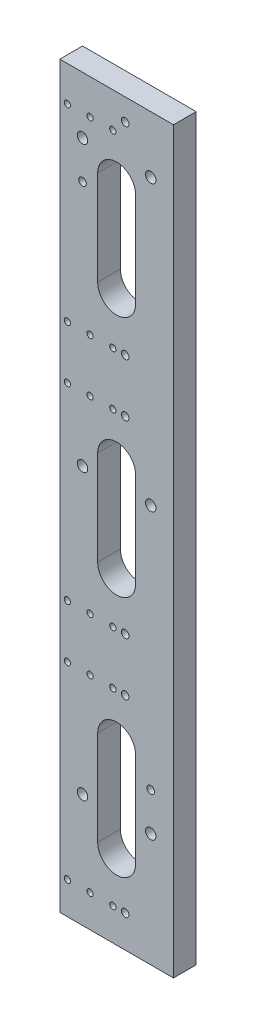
ISO-10303-21;
HEADER;
FILE_DESCRIPTION(('STEP AP214'),'2;1');
FILE_NAME('part.step','',(''),(''),'','','');
FILE_SCHEMA(('AUTOMOTIVE_DESIGN { 1 0 10303 214 1 1 1 1 }'));
ENDSEC;
DATA;
#1=APPLICATION_CONTEXT('core data for automotive mechanical design processes');
#2=APPLICATION_PROTOCOL_DEFINITION('international standard','automotive_design',2000,#1);
#3=PRODUCT_CONTEXT('',#1,'mechanical');
#4=PRODUCT('Part','Part','',(#3));
#5=PRODUCT_RELATED_PRODUCT_CATEGORY('part','',(#4));
#6=PRODUCT_DEFINITION_FORMATION('','',#4);
#7=PRODUCT_DEFINITION_CONTEXT('part definition',#1,'design');
#8=PRODUCT_DEFINITION('design','',#6,#7);
#9=PRODUCT_DEFINITION_SHAPE('','',#8);
#10=(LENGTH_UNIT() NAMED_UNIT(*) SI_UNIT(.MILLI.,.METRE.));
#11=(NAMED_UNIT(*) PLANE_ANGLE_UNIT() SI_UNIT($,.RADIAN.));
#12=(NAMED_UNIT(*) SI_UNIT($,.STERADIAN.) SOLID_ANGLE_UNIT());
#13=UNCERTAINTY_MEASURE_WITH_UNIT(LENGTH_MEASURE(1.E-05),#10,'distance_accuracy_value','');
#14=(GEOMETRIC_REPRESENTATION_CONTEXT(3) GLOBAL_UNCERTAINTY_ASSIGNED_CONTEXT((#13)) GLOBAL_UNIT_ASSIGNED_CONTEXT((#10,
#11,#12)) REPRESENTATION_CONTEXT('',''));
#15=CARTESIAN_POINT('',(0.,0.,0.));
#16=DIRECTION('',(0.,0.,1.));
#17=DIRECTION('',(1.,0.,0.));
#18=AXIS2_PLACEMENT_3D('',#15,#16,#17);
#19=CARTESIAN_POINT('',(14.1485562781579,232.812619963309,12.));
#20=DIRECTION('',(1.,0.,0.));
#21=DIRECTION('',(0.,0.,-1.));
#22=AXIS2_PLACEMENT_3D('',#19,#20,#21);
#23=PLANE('',#22);
#24=DIRECTION('',(0.,-1.,0.));
#25=VECTOR('',#24,1.);
#26=CARTESIAN_POINT('',(14.1485562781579,232.812619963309,0.));
#27=LINE('',#26,#25);
#28=CARTESIAN_POINT('',(14.1485562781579,632.812619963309,0.));
#29=VERTEX_POINT('',#28);
#30=CARTESIAN_POINT('',(14.1485562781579,242.812619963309,0.));
#31=VERTEX_POINT('',#30);
#32=EDGE_CURVE('E466',#29,#31,#27,.T.);
#33=ORIENTED_EDGE('',*,*,#32,.T.);
#34=DIRECTION('',(0.,0.,-1.));
#35=VECTOR('',#34,1.);
#36=CARTESIAN_POINT('',(14.1485562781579,242.812619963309,12.));
#37=LINE('',#36,#35);
#38=CARTESIAN_POINT('',(14.1485562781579,242.812619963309,12.));
#39=VERTEX_POINT('',#38);
#40=EDGE_CURVE('E316',#39,#31,#37,.T.);
#41=ORIENTED_EDGE('',*,*,#40,.F.);
#42=DIRECTION('',(0.,-1.,0.));
#43=VECTOR('',#42,1.);
#44=CARTESIAN_POINT('',(14.1485562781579,232.812619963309,12.));
#45=LINE('',#44,#43);
#46=CARTESIAN_POINT('',(14.1485562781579,632.812619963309,12.));
#47=VERTEX_POINT('',#46);
#48=EDGE_CURVE('E467',#47,#39,#45,.T.);
#49=ORIENTED_EDGE('',*,*,#48,.F.);
#50=DIRECTION('',(0.,0.,-1.));
#51=VECTOR('',#50,1.);
#52=CARTESIAN_POINT('',(14.1485562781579,632.812619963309,12.));
#53=LINE('',#52,#51);
#54=EDGE_CURVE('E23',#47,#29,#53,.T.);
#55=ORIENTED_EDGE('',*,*,#54,.T.);
#56=EDGE_LOOP('',(#33,#41,#49,#55));
#57=FACE_BOUND('',#56,.T.);
#58=ADVANCED_FACE('F16',(#57),#23,.F.);
#59=CARTESIAN_POINT('',(74.1485562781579,232.812619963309,12.));
#60=DIRECTION('',(-1.,0.,0.));
#61=DIRECTION('',(0.,0.,1.));
#62=AXIS2_PLACEMENT_3D('',#59,#60,#61);
#63=PLANE('',#62);
#64=DIRECTION('',(0.,1.,0.));
#65=VECTOR('',#64,1.);
#66=CARTESIAN_POINT('',(74.1485562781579,232.812619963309,12.));
#67=LINE('',#66,#65);
#68=CARTESIAN_POINT('',(74.1485562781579,242.812619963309,12.));
#69=VERTEX_POINT('',#68);
#70=CARTESIAN_POINT('',(74.1485562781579,632.812619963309,12.));
#71=VERTEX_POINT('',#70);
#72=EDGE_CURVE('E470',#69,#71,#67,.T.);
#73=ORIENTED_EDGE('',*,*,#72,.F.);
#74=DIRECTION('',(0.,0.,-1.));
#75=VECTOR('',#74,1.);
#76=CARTESIAN_POINT('',(74.1485562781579,242.812619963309,12.));
#77=LINE('',#76,#75);
#78=CARTESIAN_POINT('',(74.1485562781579,242.812619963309,0.));
#79=VERTEX_POINT('',#78);
#80=EDGE_CURVE('E318',#69,#79,#77,.T.);
#81=ORIENTED_EDGE('',*,*,#80,.T.);
#82=DIRECTION('',(0.,1.,0.));
#83=VECTOR('',#82,1.);
#84=CARTESIAN_POINT('',(74.1485562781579,232.812619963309,0.));
#85=LINE('',#84,#83);
#86=CARTESIAN_POINT('',(74.1485562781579,632.812619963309,0.));
#87=VERTEX_POINT('',#86);
#88=EDGE_CURVE('E477',#79,#87,#85,.T.);
#89=ORIENTED_EDGE('',*,*,#88,.T.);
#90=DIRECTION('',(0.,0.,-1.));
#91=VECTOR('',#90,1.);
#92=CARTESIAN_POINT('',(74.1485562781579,632.812619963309,12.));
#93=LINE('',#92,#91);
#94=EDGE_CURVE('E11',#71,#87,#93,.T.);
#95=ORIENTED_EDGE('',*,*,#94,.F.);
#96=EDGE_LOOP('',(#73,#81,#89,#95));
#97=FACE_BOUND('',#96,.T.);
#98=ADVANCED_FACE('F497',(#97),#63,.F.);
#99=CARTESIAN_POINT('',(14.1485562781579,632.812619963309,12.));
#100=DIRECTION('',(0.,-1.,0.));
#101=DIRECTION('',(0.,0.,-1.));
#102=AXIS2_PLACEMENT_3D('',#99,#100,#101);
#103=PLANE('',#102);
#104=DIRECTION('',(-1.,0.,0.));
#105=VECTOR('',#104,1.);
#106=CARTESIAN_POINT('',(14.1485562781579,632.812619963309,0.));
#107=LINE('',#106,#105);
#108=EDGE_CURVE('E471',#87,#29,#107,.T.);
#109=ORIENTED_EDGE('',*,*,#108,.T.);
#110=ORIENTED_EDGE('',*,*,#54,.F.);
#111=DIRECTION('',(-1.,0.,0.));
#112=VECTOR('',#111,1.);
#113=CARTESIAN_POINT('',(14.1485562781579,632.812619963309,12.));
#114=LINE('',#113,#112);
#115=EDGE_CURVE('E473',#71,#47,#114,.T.);
#116=ORIENTED_EDGE('',*,*,#115,.F.);
#117=ORIENTED_EDGE('',*,*,#94,.T.);
#118=EDGE_LOOP('',(#109,#110,#116,#117));
#119=FACE_BOUND('',#118,.T.);
#120=ADVANCED_FACE('F500',(#119),#103,.F.);
#121=CARTESIAN_POINT('',(0.,0.,12.));
#122=DIRECTION('',(0.,0.,-1.));
#123=DIRECTION('',(-1.,0.,0.));
#124=AXIS2_PLACEMENT_3D('',#121,#122,#123);
#125=PLANE('',#124);
#126=DIRECTION('',(0.,1.,0.));
#127=VECTOR('',#126,1.);
#128=CARTESIAN_POINT('',(34.148556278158,334.812619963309,12.));
#129=LINE('',#128,#127);
#130=CARTESIAN_POINT('',(34.148556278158,284.812619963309,12.));
#131=VERTEX_POINT('',#130);
#132=CARTESIAN_POINT('',(34.148556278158,334.812619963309,12.));
#133=VERTEX_POINT('',#132);
#134=EDGE_CURVE('E136',#131,#133,#129,.T.);
#135=ORIENTED_EDGE('',*,*,#134,.T.);
#136=CARTESIAN_POINT('',(44.148556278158,334.812619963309,12.));
#137=DIRECTION('',(0.,0.,-1.));
#138=DIRECTION('',(-1.,0.,0.));
#139=AXIS2_PLACEMENT_3D('',#136,#137,#138);
#140=CIRCLE('',#139,10.);
#141=CARTESIAN_POINT('',(54.1485562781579,334.812619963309,12.));
#142=VERTEX_POINT('',#141);
#143=EDGE_CURVE('E130',#133,#142,#140,.T.);
#144=ORIENTED_EDGE('',*,*,#143,.T.);
#145=DIRECTION('',(0.,-1.,0.));
#146=VECTOR('',#145,1.);
#147=CARTESIAN_POINT('',(54.1485562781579,334.812619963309,12.));
#148=LINE('',#147,#146);
#149=CARTESIAN_POINT('',(54.1485562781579,284.812619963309,12.));
#150=VERTEX_POINT('',#149);
#151=EDGE_CURVE('E139',#142,#150,#148,.T.);
#152=ORIENTED_EDGE('',*,*,#151,.T.);
#153=CARTESIAN_POINT('',(44.148556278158,284.812619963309,12.));
#154=DIRECTION('',(0.,0.,-1.));
#155=DIRECTION('',(-1.,0.,0.));
#156=AXIS2_PLACEMENT_3D('',#153,#154,#155);
#157=CIRCLE('',#156,10.);
#158=EDGE_CURVE('E30',#150,#131,#157,.T.);
#159=ORIENTED_EDGE('',*,*,#158,.T.);
#160=EDGE_LOOP('',(#135,#144,#152,#159));
#161=FACE_BOUND('',#160,.T.);
#162=DIRECTION('',(0.,1.,0.));
#163=VECTOR('',#162,1.);
#164=CARTESIAN_POINT('',(34.148556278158,462.812619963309,12.));
#165=LINE('',#164,#163);
#166=CARTESIAN_POINT('',(34.148556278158,412.812619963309,12.));
#167=VERTEX_POINT('',#166);
#168=CARTESIAN_POINT('',(34.148556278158,462.812619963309,12.));
#169=VERTEX_POINT('',#168);
#170=EDGE_CURVE('E175',#167,#169,#165,.T.);
#171=ORIENTED_EDGE('',*,*,#170,.T.);
#172=CARTESIAN_POINT('',(44.148556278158,462.812619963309,12.));
#173=DIRECTION('',(0.,0.,-1.));
#174=DIRECTION('',(-1.,0.,0.));
#175=AXIS2_PLACEMENT_3D('',#172,#173,#174);
#176=CIRCLE('',#175,10.);
#177=CARTESIAN_POINT('',(54.148556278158,462.812619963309,12.));
#178=VERTEX_POINT('',#177);
#179=EDGE_CURVE('E165',#169,#178,#176,.T.);
#180=ORIENTED_EDGE('',*,*,#179,.T.);
#181=DIRECTION('',(0.,-1.,0.));
#182=VECTOR('',#181,1.);
#183=CARTESIAN_POINT('',(54.148556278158,462.812619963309,12.));
#184=LINE('',#183,#182);
#185=CARTESIAN_POINT('',(54.148556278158,412.812619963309,12.));
#186=VERTEX_POINT('',#185);
#187=EDGE_CURVE('E168',#178,#186,#184,.T.);
#188=ORIENTED_EDGE('',*,*,#187,.T.);
#189=CARTESIAN_POINT('',(44.148556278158,412.812619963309,12.));
#190=DIRECTION('',(0.,0.,-1.));
#191=DIRECTION('',(-1.,0.,0.));
#192=AXIS2_PLACEMENT_3D('',#189,#190,#191);
#193=CIRCLE('',#192,10.);
#194=EDGE_CURVE('E172',#186,#167,#193,.T.);
#195=ORIENTED_EDGE('',*,*,#194,.T.);
#196=EDGE_LOOP('',(#171,#180,#188,#195));
#197=FACE_BOUND('',#196,.T.);
#198=DIRECTION('',(0.,1.,0.));
#199=VECTOR('',#198,1.);
#200=CARTESIAN_POINT('',(34.148556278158,590.812619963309,12.));
#201=LINE('',#200,#199);
#202=CARTESIAN_POINT('',(34.148556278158,540.812619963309,12.));
#203=VERTEX_POINT('',#202);
#204=CARTESIAN_POINT('',(34.148556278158,590.812619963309,12.));
#205=VERTEX_POINT('',#204);
#206=EDGE_CURVE('E207',#203,#205,#201,.T.);
#207=ORIENTED_EDGE('',*,*,#206,.T.);
#208=CARTESIAN_POINT('',(44.148556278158,590.812619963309,12.));
#209=DIRECTION('',(0.,0.,-1.));
#210=DIRECTION('',(-1.,0.,0.));
#211=AXIS2_PLACEMENT_3D('',#208,#209,#210);
#212=CIRCLE('',#211,10.);
#213=CARTESIAN_POINT('',(54.148556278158,590.812619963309,12.));
#214=VERTEX_POINT('',#213);
#215=EDGE_CURVE('E197',#205,#214,#212,.T.);
#216=ORIENTED_EDGE('',*,*,#215,.T.);
#217=DIRECTION('',(0.,-1.,0.));
#218=VECTOR('',#217,1.);
#219=CARTESIAN_POINT('',(54.148556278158,590.812619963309,12.));
#220=LINE('',#219,#218);
#221=CARTESIAN_POINT('',(54.148556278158,540.812619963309,12.));
#222=VERTEX_POINT('',#221);
#223=EDGE_CURVE('E200',#214,#222,#220,.T.);
#224=ORIENTED_EDGE('',*,*,#223,.T.);
#225=CARTESIAN_POINT('',(44.148556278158,540.812619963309,12.));
#226=DIRECTION('',(0.,0.,-1.));
#227=DIRECTION('',(-1.,0.,0.));
#228=AXIS2_PLACEMENT_3D('',#225,#226,#227);
#229=CIRCLE('',#228,10.);
#230=EDGE_CURVE('E204',#222,#203,#229,.T.);
#231=ORIENTED_EDGE('',*,*,#230,.T.);
#232=EDGE_LOOP('',(#207,#216,#224,#231));
#233=FACE_BOUND('',#232,.T.);
#234=CARTESIAN_POINT('',(26.148556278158,582.812619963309,12.));
#235=DIRECTION('',(0.,0.,-1.));
#236=DIRECTION('',(-1.,0.,0.));
#237=AXIS2_PLACEMENT_3D('',#234,#235,#236);
#238=CIRCLE('',#237,2.);
#239=CARTESIAN_POINT('',(24.148556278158,582.812619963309,12.));
#240=VERTEX_POINT('',#239);
#241=EDGE_CURVE('E231',#240,#240,#238,.T.);
#242=ORIENTED_EDGE('',*,*,#241,.T.);
#243=EDGE_LOOP('',(#242));
#244=FACE_BOUND('',#243,.T.);
#245=CARTESIAN_POINT('',(62.148556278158,322.812619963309,12.));
#246=DIRECTION('',(0.,0.,-1.));
#247=DIRECTION('',(-1.,0.,0.));
#248=AXIS2_PLACEMENT_3D('',#245,#246,#247);
#249=CIRCLE('',#248,2.);
#250=CARTESIAN_POINT('',(60.148556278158,322.812619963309,12.));
#251=VERTEX_POINT('',#250);
#252=EDGE_CURVE('E237',#251,#251,#249,.T.);
#253=ORIENTED_EDGE('',*,*,#252,.T.);
#254=EDGE_LOOP('',(#253));
#255=FACE_BOUND('',#254,.T.);
#256=CARTESIAN_POINT('',(26.148556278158,602.812619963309,12.));
#257=DIRECTION('',(0.,0.,-1.));
#258=DIRECTION('',(-1.,0.,0.));
#259=AXIS2_PLACEMENT_3D('',#256,#257,#258);
#260=CIRCLE('',#259,2.75);
#261=CARTESIAN_POINT('',(23.398556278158,602.812619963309,12.));
#262=VERTEX_POINT('',#261);
#263=EDGE_CURVE('E249',#262,#262,#260,.T.);
#264=ORIENTED_EDGE('',*,*,#263,.T.);
#265=EDGE_LOOP('',(#264));
#266=FACE_BOUND('',#265,.T.);
#267=CARTESIAN_POINT('',(62.148556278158,602.812619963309,12.));
#268=DIRECTION('',(0.,0.,-1.));
#269=DIRECTION('',(-1.,0.,0.));
#270=AXIS2_PLACEMENT_3D('',#267,#268,#269);
#271=CIRCLE('',#270,2.75);
#272=CARTESIAN_POINT('',(59.398556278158,602.812619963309,12.));
#273=VERTEX_POINT('',#272);
#274=EDGE_CURVE('E261',#273,#273,#271,.T.);
#275=ORIENTED_EDGE('',*,*,#274,.T.);
#276=EDGE_LOOP('',(#275));
#277=FACE_BOUND('',#276,.T.);
#278=CARTESIAN_POINT('',(62.148556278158,452.812619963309,12.));
#279=DIRECTION('',(0.,0.,-1.));
#280=DIRECTION('',(-1.,0.,0.));
#281=AXIS2_PLACEMENT_3D('',#278,#279,#280);
#282=CIRCLE('',#281,2.75);
#283=CARTESIAN_POINT('',(59.398556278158,452.812619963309,12.));
#284=VERTEX_POINT('',#283);
#285=EDGE_CURVE('E273',#284,#284,#282,.T.);
#286=ORIENTED_EDGE('',*,*,#285,.T.);
#287=EDGE_LOOP('',(#286));
#288=FACE_BOUND('',#287,.T.);
#289=CARTESIAN_POINT('',(26.148556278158,452.812619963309,12.));
#290=DIRECTION('',(0.,0.,-1.));
#291=DIRECTION('',(-1.,0.,0.));
#292=AXIS2_PLACEMENT_3D('',#289,#290,#291);
#293=CIRCLE('',#292,2.75);
#294=CARTESIAN_POINT('',(23.398556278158,452.812619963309,12.));
#295=VERTEX_POINT('',#294);
#296=EDGE_CURVE('E285',#295,#295,#293,.T.);
#297=ORIENTED_EDGE('',*,*,#296,.T.);
#298=EDGE_LOOP('',(#297));
#299=FACE_BOUND('',#298,.T.);
#300=CARTESIAN_POINT('',(26.148556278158,302.812619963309,12.));
#301=DIRECTION('',(0.,0.,-1.));
#302=DIRECTION('',(-1.,0.,0.));
#303=AXIS2_PLACEMENT_3D('',#300,#301,#302);
#304=CIRCLE('',#303,2.75);
#305=CARTESIAN_POINT('',(23.398556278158,302.812619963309,12.));
#306=VERTEX_POINT('',#305);
#307=EDGE_CURVE('E297',#306,#306,#304,.T.);
#308=ORIENTED_EDGE('',*,*,#307,.T.);
#309=EDGE_LOOP('',(#308));
#310=FACE_BOUND('',#309,.T.);
#311=CARTESIAN_POINT('',(62.148556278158,302.812619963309,12.));
#312=DIRECTION('',(0.,0.,-1.));
#313=DIRECTION('',(-1.,0.,0.));
#314=AXIS2_PLACEMENT_3D('',#311,#312,#313);
#315=CIRCLE('',#314,2.75);
#316=CARTESIAN_POINT('',(59.398556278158,302.812619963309,12.));
#317=VERTEX_POINT('',#316);
#318=EDGE_CURVE('E309',#317,#317,#315,.T.);
#319=ORIENTED_EDGE('',*,*,#318,.T.);
#320=EDGE_LOOP('',(#319));
#321=FACE_BOUND('',#320,.T.);
#322=CARTESIAN_POINT('',(48.6485562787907,621.312619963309,12.));
#323=DIRECTION('',(0.,0.,-1.));
#324=DIRECTION('',(-1.,0.,0.));
#325=AXIS2_PLACEMENT_3D('',#322,#323,#324);
#326=CIRCLE('',#325,2.);
#327=CARTESIAN_POINT('',(46.6485562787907,621.312619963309,12.));
#328=VERTEX_POINT('',#327);
#329=EDGE_CURVE('E325',#328,#328,#326,.T.);
#330=ORIENTED_EDGE('',*,*,#329,.T.);
#331=EDGE_LOOP('',(#330));
#332=FACE_BOUND('',#331,.T.);
#333=CARTESIAN_POINT('',(48.6485562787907,486.812619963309,12.));
#334=DIRECTION('',(0.,0.,-1.));
#335=DIRECTION('',(-1.,0.,0.));
#336=AXIS2_PLACEMENT_3D('',#333,#334,#335);
#337=CIRCLE('',#336,2.);
#338=CARTESIAN_POINT('',(46.6485562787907,486.812619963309,12.));
#339=VERTEX_POINT('',#338);
#340=EDGE_CURVE('E331',#339,#339,#337,.T.);
#341=ORIENTED_EDGE('',*,*,#340,.T.);
#342=EDGE_LOOP('',(#341));
#343=FACE_BOUND('',#342,.T.);
#344=CARTESIAN_POINT('',(48.6485562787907,514.812619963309,12.));
#345=DIRECTION('',(0.,0.,-1.));
#346=DIRECTION('',(-1.,0.,0.));
#347=AXIS2_PLACEMENT_3D('',#344,#345,#346);
#348=CIRCLE('',#347,2.);
#349=CARTESIAN_POINT('',(46.6485562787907,514.812619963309,12.));
#350=VERTEX_POINT('',#349);
#351=EDGE_CURVE('E337',#350,#350,#348,.T.);
#352=ORIENTED_EDGE('',*,*,#351,.T.);
#353=EDGE_LOOP('',(#352));
#354=FACE_BOUND('',#353,.T.);
#355=CARTESIAN_POINT('',(48.6485562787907,259.812619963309,12.));
#356=DIRECTION('',(0.,0.,-1.));
#357=DIRECTION('',(-1.,0.,0.));
#358=AXIS2_PLACEMENT_3D('',#355,#356,#357);
#359=CIRCLE('',#358,2.);
#360=CARTESIAN_POINT('',(46.6485562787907,259.812619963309,12.));
#361=VERTEX_POINT('',#360);
#362=EDGE_CURVE('E343',#361,#361,#359,.T.);
#363=ORIENTED_EDGE('',*,*,#362,.T.);
#364=EDGE_LOOP('',(#363));
#365=FACE_BOUND('',#364,.T.);
#366=CARTESIAN_POINT('',(48.6485562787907,387.312619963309,12.));
#367=DIRECTION('',(0.,0.,-1.));
#368=DIRECTION('',(-1.,0.,0.));
#369=AXIS2_PLACEMENT_3D('',#366,#367,#368);
#370=CIRCLE('',#369,2.);
#371=CARTESIAN_POINT('',(46.6485562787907,387.312619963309,12.));
#372=VERTEX_POINT('',#371);
#373=EDGE_CURVE('E349',#372,#372,#370,.T.);
#374=ORIENTED_EDGE('',*,*,#373,.T.);
#375=EDGE_LOOP('',(#374));
#376=FACE_BOUND('',#375,.T.);
#377=CARTESIAN_POINT('',(48.6485562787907,359.312619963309,12.));
#378=DIRECTION('',(0.,0.,-1.));
#379=DIRECTION('',(-1.,0.,0.));
#380=AXIS2_PLACEMENT_3D('',#377,#378,#379);
#381=CIRCLE('',#380,2.);
#382=CARTESIAN_POINT('',(46.6485562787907,359.312619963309,12.));
#383=VERTEX_POINT('',#382);
#384=EDGE_CURVE('E355',#383,#383,#381,.T.);
#385=ORIENTED_EDGE('',*,*,#384,.T.);
#386=EDGE_LOOP('',(#385));
#387=FACE_BOUND('',#386,.T.);
#388=CARTESIAN_POINT('',(30.1485562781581,614.312619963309,12.));
#389=DIRECTION('',(0.,0.,-1.));
#390=DIRECTION('',(-1.,0.,0.));
#391=AXIS2_PLACEMENT_3D('',#388,#389,#390);
#392=CIRCLE('',#391,1.65);
#393=CARTESIAN_POINT('',(28.4985562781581,614.312619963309,12.));
#394=VERTEX_POINT('',#393);
#395=EDGE_CURVE('E361',#394,#394,#392,.T.);
#396=ORIENTED_EDGE('',*,*,#395,.T.);
#397=EDGE_LOOP('',(#396));
#398=FACE_BOUND('',#397,.T.);
#399=CARTESIAN_POINT('',(18.1485562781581,614.312619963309,12.));
#400=DIRECTION('',(0.,0.,-1.));
#401=DIRECTION('',(-1.,0.,0.));
#402=AXIS2_PLACEMENT_3D('',#399,#400,#401);
#403=CIRCLE('',#402,1.65);
#404=CARTESIAN_POINT('',(16.4985562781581,614.312619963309,12.));
#405=VERTEX_POINT('',#404);
#406=EDGE_CURVE('E367',#405,#405,#403,.T.);
#407=ORIENTED_EDGE('',*,*,#406,.T.);
#408=EDGE_LOOP('',(#407));
#409=FACE_BOUND('',#408,.T.);
#410=CARTESIAN_POINT('',(30.1485562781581,514.812619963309,12.));
#411=DIRECTION('',(0.,0.,-1.));
#412=DIRECTION('',(-1.,0.,0.));
#413=AXIS2_PLACEMENT_3D('',#410,#411,#412);
#414=CIRCLE('',#413,1.65);
#415=CARTESIAN_POINT('',(28.4985562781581,514.812619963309,12.));
#416=VERTEX_POINT('',#415);
#417=EDGE_CURVE('E373',#416,#416,#414,.T.);
#418=ORIENTED_EDGE('',*,*,#417,.T.);
#419=EDGE_LOOP('',(#418));
#420=FACE_BOUND('',#419,.T.);
#421=CARTESIAN_POINT('',(18.1485562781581,514.812619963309,12.));
#422=DIRECTION('',(0.,0.,-1.));
#423=DIRECTION('',(-1.,0.,0.));
#424=AXIS2_PLACEMENT_3D('',#421,#422,#423);
#425=CIRCLE('',#424,1.65);
#426=CARTESIAN_POINT('',(16.4985562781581,514.812619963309,12.));
#427=VERTEX_POINT('',#426);
#428=EDGE_CURVE('E379',#427,#427,#425,.T.);
#429=ORIENTED_EDGE('',*,*,#428,.T.);
#430=EDGE_LOOP('',(#429));
#431=FACE_BOUND('',#430,.T.);
#432=CARTESIAN_POINT('',(18.1485562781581,486.812619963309,12.));
#433=DIRECTION('',(0.,0.,-1.));
#434=DIRECTION('',(-1.,0.,0.));
#435=AXIS2_PLACEMENT_3D('',#432,#433,#434);
#436=CIRCLE('',#435,1.65);
#437=CARTESIAN_POINT('',(16.4985562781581,486.812619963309,12.));
#438=VERTEX_POINT('',#437);
#439=EDGE_CURVE('E385',#438,#438,#436,.T.);
#440=ORIENTED_EDGE('',*,*,#439,.T.);
#441=EDGE_LOOP('',(#440));
#442=FACE_BOUND('',#441,.T.);
#443=CARTESIAN_POINT('',(30.1485562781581,486.812619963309,12.));
#444=DIRECTION('',(0.,0.,-1.));
#445=DIRECTION('',(-1.,0.,0.));
#446=AXIS2_PLACEMENT_3D('',#443,#444,#445);
#447=CIRCLE('',#446,1.65);
#448=CARTESIAN_POINT('',(28.4985562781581,486.812619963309,12.));
#449=VERTEX_POINT('',#448);
#450=EDGE_CURVE('E391',#449,#449,#447,.T.);
#451=ORIENTED_EDGE('',*,*,#450,.T.);
#452=EDGE_LOOP('',(#451));
#453=FACE_BOUND('',#452,.T.);
#454=CARTESIAN_POINT('',(18.1485562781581,259.812619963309,12.));
#455=DIRECTION('',(0.,0.,-1.));
#456=DIRECTION('',(-1.,0.,0.));
#457=AXIS2_PLACEMENT_3D('',#454,#455,#456);
#458=CIRCLE('',#457,1.65);
#459=CARTESIAN_POINT('',(16.4985562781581,259.812619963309,12.));
#460=VERTEX_POINT('',#459);
#461=EDGE_CURVE('E397',#460,#460,#458,.T.);
#462=ORIENTED_EDGE('',*,*,#461,.T.);
#463=EDGE_LOOP('',(#462));
#464=FACE_BOUND('',#463,.T.);
#465=CARTESIAN_POINT('',(30.1485562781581,259.812619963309,12.));
#466=DIRECTION('',(0.,0.,-1.));
#467=DIRECTION('',(-1.,0.,0.));
#468=AXIS2_PLACEMENT_3D('',#465,#466,#467);
#469=CIRCLE('',#468,1.65);
#470=CARTESIAN_POINT('',(28.4985562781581,259.812619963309,12.));
#471=VERTEX_POINT('',#470);
#472=EDGE_CURVE('E403',#471,#471,#469,.T.);
#473=ORIENTED_EDGE('',*,*,#472,.T.);
#474=EDGE_LOOP('',(#473));
#475=FACE_BOUND('',#474,.T.);
#476=CARTESIAN_POINT('',(18.1485562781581,387.312619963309,12.));
#477=DIRECTION('',(0.,0.,-1.));
#478=DIRECTION('',(-1.,0.,0.));
#479=AXIS2_PLACEMENT_3D('',#476,#477,#478);
#480=CIRCLE('',#479,1.65);
#481=CARTESIAN_POINT('',(16.4985562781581,387.312619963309,12.));
#482=VERTEX_POINT('',#481);
#483=EDGE_CURVE('E409',#482,#482,#480,.T.);
#484=ORIENTED_EDGE('',*,*,#483,.T.);
#485=EDGE_LOOP('',(#484));
#486=FACE_BOUND('',#485,.T.);
#487=CARTESIAN_POINT('',(30.1485562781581,387.312619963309,12.));
#488=DIRECTION('',(0.,0.,-1.));
#489=DIRECTION('',(-1.,0.,0.));
#490=AXIS2_PLACEMENT_3D('',#487,#488,#489);
#491=CIRCLE('',#490,1.65);
#492=CARTESIAN_POINT('',(28.4985562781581,387.312619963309,12.));
#493=VERTEX_POINT('',#492);
#494=EDGE_CURVE('E415',#493,#493,#491,.T.);
#495=ORIENTED_EDGE('',*,*,#494,.T.);
#496=EDGE_LOOP('',(#495));
#497=FACE_BOUND('',#496,.T.);
#498=CARTESIAN_POINT('',(30.148556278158,359.312619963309,12.));
#499=DIRECTION('',(0.,0.,-1.));
#500=DIRECTION('',(-1.,0.,0.));
#501=AXIS2_PLACEMENT_3D('',#498,#499,#500);
#502=CIRCLE('',#501,1.65);
#503=CARTESIAN_POINT('',(28.498556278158,359.312619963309,12.));
#504=VERTEX_POINT('',#503);
#505=EDGE_CURVE('E421',#504,#504,#502,.T.);
#506=ORIENTED_EDGE('',*,*,#505,.T.);
#507=EDGE_LOOP('',(#506));
#508=FACE_BOUND('',#507,.T.);
#509=CARTESIAN_POINT('',(18.1485562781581,359.312619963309,12.));
#510=DIRECTION('',(0.,0.,-1.));
#511=DIRECTION('',(-1.,0.,0.));
#512=AXIS2_PLACEMENT_3D('',#509,#510,#511);
#513=CIRCLE('',#512,1.65);
#514=CARTESIAN_POINT('',(16.4985562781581,359.312619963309,12.));
#515=VERTEX_POINT('',#514);
#516=EDGE_CURVE('E427',#515,#515,#513,.T.);
#517=ORIENTED_EDGE('',*,*,#516,.T.);
#518=EDGE_LOOP('',(#517));
#519=FACE_BOUND('',#518,.T.);
#520=CARTESIAN_POINT('',(42.148556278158,614.312619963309,12.));
#521=DIRECTION('',(0.,0.,-1.));
#522=DIRECTION('',(-1.,0.,0.));
#523=AXIS2_PLACEMENT_3D('',#520,#521,#522);
#524=CIRCLE('',#523,1.65);
#525=CARTESIAN_POINT('',(40.498556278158,614.312619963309,12.));
#526=VERTEX_POINT('',#525);
#527=EDGE_CURVE('E433',#526,#526,#524,.T.);
#528=ORIENTED_EDGE('',*,*,#527,.T.);
#529=EDGE_LOOP('',(#528));
#530=FACE_BOUND('',#529,.T.);
#531=CARTESIAN_POINT('',(42.1485562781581,514.812619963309,12.));
#532=DIRECTION('',(0.,0.,-1.));
#533=DIRECTION('',(-1.,0.,0.));
#534=AXIS2_PLACEMENT_3D('',#531,#532,#533);
#535=CIRCLE('',#534,1.65);
#536=CARTESIAN_POINT('',(40.4985562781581,514.812619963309,12.));
#537=VERTEX_POINT('',#536);
#538=EDGE_CURVE('E439',#537,#537,#535,.T.);
#539=ORIENTED_EDGE('',*,*,#538,.T.);
#540=EDGE_LOOP('',(#539));
#541=FACE_BOUND('',#540,.T.);
#542=CARTESIAN_POINT('',(42.1485562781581,486.812619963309,12.));
#543=DIRECTION('',(0.,0.,-1.));
#544=DIRECTION('',(-1.,0.,0.));
#545=AXIS2_PLACEMENT_3D('',#542,#543,#544);
#546=CIRCLE('',#545,1.65);
#547=CARTESIAN_POINT('',(40.4985562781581,486.812619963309,12.));
#548=VERTEX_POINT('',#547);
#549=EDGE_CURVE('E445',#548,#548,#546,.T.);
#550=ORIENTED_EDGE('',*,*,#549,.T.);
#551=EDGE_LOOP('',(#550));
#552=FACE_BOUND('',#551,.T.);
#553=CARTESIAN_POINT('',(42.1485562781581,387.312619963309,12.));
#554=DIRECTION('',(0.,0.,-1.));
#555=DIRECTION('',(-1.,0.,0.));
#556=AXIS2_PLACEMENT_3D('',#553,#554,#555);
#557=CIRCLE('',#556,1.65);
#558=CARTESIAN_POINT('',(40.4985562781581,387.312619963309,12.));
#559=VERTEX_POINT('',#558);
#560=EDGE_CURVE('E451',#559,#559,#557,.T.);
#561=ORIENTED_EDGE('',*,*,#560,.T.);
#562=EDGE_LOOP('',(#561));
#563=FACE_BOUND('',#562,.T.);
#564=CARTESIAN_POINT('',(42.148556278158,359.312619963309,12.));
#565=DIRECTION('',(0.,0.,-1.));
#566=DIRECTION('',(-1.,0.,0.));
#567=AXIS2_PLACEMENT_3D('',#564,#565,#566);
#568=CIRCLE('',#567,1.65);
#569=CARTESIAN_POINT('',(40.498556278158,359.312619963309,12.));
#570=VERTEX_POINT('',#569);
#571=EDGE_CURVE('E457',#570,#570,#568,.T.);
#572=ORIENTED_EDGE('',*,*,#571,.T.);
#573=EDGE_LOOP('',(#572));
#574=FACE_BOUND('',#573,.T.);
#575=CARTESIAN_POINT('',(42.1485562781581,259.812619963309,12.));
#576=DIRECTION('',(0.,0.,-1.));
#577=DIRECTION('',(-1.,0.,0.));
#578=AXIS2_PLACEMENT_3D('',#575,#576,#577);
#579=CIRCLE('',#578,1.65);
#580=CARTESIAN_POINT('',(40.4985562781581,259.812619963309,12.));
#581=VERTEX_POINT('',#580);
#582=EDGE_CURVE('E463',#581,#581,#579,.T.);
#583=ORIENTED_EDGE('',*,*,#582,.T.);
#584=EDGE_LOOP('',(#583));
#585=FACE_BOUND('',#584,.T.);
#586=ORIENTED_EDGE('',*,*,#48,.T.);
#587=DIRECTION('',(1.,0.,0.));
#588=VECTOR('',#587,1.);
#589=CARTESIAN_POINT('',(14.1485562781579,242.812619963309,12.));
#590=LINE('',#589,#588);
#591=EDGE_CURVE('E313',#39,#69,#590,.T.);
#592=ORIENTED_EDGE('',*,*,#591,.T.);
#593=ORIENTED_EDGE('',*,*,#72,.T.);
#594=ORIENTED_EDGE('',*,*,#115,.T.);
#595=EDGE_LOOP('',(#586,#592,#593,#594));
#596=FACE_BOUND('',#595,.T.);
#597=ADVANCED_FACE('F143',(#161,#197,#233,#244,#255,#266,#277,#288,#299,#310,#321,#332,#343,
#354,#365,#376,#387,#398,#409,#420,#431,#442,#453,#464,#475,#486,#497,#508,#519,#530,#541,#552,
#563,#574,#585,#596),#125,.F.);
#598=CARTESIAN_POINT('',(0.,0.,0.));
#599=DIRECTION('',(0.,0.,-1.));
#600=DIRECTION('',(-1.,0.,0.));
#601=AXIS2_PLACEMENT_3D('',#598,#599,#600);
#602=PLANE('',#601);
#603=CARTESIAN_POINT('',(44.148556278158,334.812619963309,0.));
#604=DIRECTION('',(0.,0.,-1.));
#605=DIRECTION('',(-1.,0.,0.));
#606=AXIS2_PLACEMENT_3D('',#603,#604,#605);
#607=CIRCLE('',#606,10.);
#608=CARTESIAN_POINT('',(34.148556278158,334.812619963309,0.));
#609=VERTEX_POINT('',#608);
#610=CARTESIAN_POINT('',(54.1485562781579,334.812619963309,0.));
#611=VERTEX_POINT('',#610);
#612=EDGE_CURVE('E38',#609,#611,#607,.T.);
#613=ORIENTED_EDGE('',*,*,#612,.F.);
#614=DIRECTION('',(0.,1.,0.));
#615=VECTOR('',#614,1.);
#616=CARTESIAN_POINT('',(34.148556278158,334.812619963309,0.));
#617=LINE('',#616,#615);
#618=CARTESIAN_POINT('',(34.148556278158,284.812619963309,0.));
#619=VERTEX_POINT('',#618);
#620=EDGE_CURVE('E146',#619,#609,#617,.T.);
#621=ORIENTED_EDGE('',*,*,#620,.F.);
#622=CARTESIAN_POINT('',(44.148556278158,284.812619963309,0.));
#623=DIRECTION('',(0.,0.,-1.));
#624=DIRECTION('',(-1.,0.,0.));
#625=AXIS2_PLACEMENT_3D('',#622,#623,#624);
#626=CIRCLE('',#625,10.);
#627=CARTESIAN_POINT('',(54.1485562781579,284.812619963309,0.));
#628=VERTEX_POINT('',#627);
#629=EDGE_CURVE('E149',#628,#619,#626,.T.);
#630=ORIENTED_EDGE('',*,*,#629,.F.);
#631=DIRECTION('',(0.,-1.,0.));
#632=VECTOR('',#631,1.);
#633=CARTESIAN_POINT('',(54.1485562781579,334.812619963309,0.));
#634=LINE('',#633,#632);
#635=EDGE_CURVE('E155',#611,#628,#634,.T.);
#636=ORIENTED_EDGE('',*,*,#635,.F.);
#637=EDGE_LOOP('',(#613,#621,#630,#636));
#638=FACE_BOUND('',#637,.T.);
#639=CARTESIAN_POINT('',(44.148556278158,462.812619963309,0.));
#640=DIRECTION('',(0.,0.,-1.));
#641=DIRECTION('',(-1.,0.,0.));
#642=AXIS2_PLACEMENT_3D('',#639,#640,#641);
#643=CIRCLE('',#642,10.);
#644=CARTESIAN_POINT('',(34.148556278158,462.812619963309,0.));
#645=VERTEX_POINT('',#644);
#646=CARTESIAN_POINT('',(54.148556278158,462.812619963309,0.));
#647=VERTEX_POINT('',#646);
#648=EDGE_CURVE('E161',#645,#647,#643,.T.);
#649=ORIENTED_EDGE('',*,*,#648,.F.);
#650=DIRECTION('',(0.,1.,0.));
#651=VECTOR('',#650,1.);
#652=CARTESIAN_POINT('',(34.148556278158,462.812619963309,0.));
#653=LINE('',#652,#651);
#654=CARTESIAN_POINT('',(34.148556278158,412.812619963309,0.));
#655=VERTEX_POINT('',#654);
#656=EDGE_CURVE('E169',#655,#645,#653,.T.);
#657=ORIENTED_EDGE('',*,*,#656,.F.);
#658=CARTESIAN_POINT('',(44.148556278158,412.812619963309,0.));
#659=DIRECTION('',(0.,0.,-1.));
#660=DIRECTION('',(-1.,0.,0.));
#661=AXIS2_PLACEMENT_3D('',#658,#659,#660);
#662=CIRCLE('',#661,10.);
#663=CARTESIAN_POINT('',(54.148556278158,412.812619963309,0.));
#664=VERTEX_POINT('',#663);
#665=EDGE_CURVE('E183',#664,#655,#662,.T.);
#666=ORIENTED_EDGE('',*,*,#665,.F.);
#667=DIRECTION('',(0.,-1.,0.));
#668=VECTOR('',#667,1.);
#669=CARTESIAN_POINT('',(54.148556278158,462.812619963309,0.));
#670=LINE('',#669,#668);
#671=EDGE_CURVE('E180',#647,#664,#670,.T.);
#672=ORIENTED_EDGE('',*,*,#671,.F.);
#673=EDGE_LOOP('',(#649,#657,#666,#672));
#674=FACE_BOUND('',#673,.T.);
#675=CARTESIAN_POINT('',(44.148556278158,590.812619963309,0.));
#676=DIRECTION('',(0.,0.,-1.));
#677=DIRECTION('',(-1.,0.,0.));
#678=AXIS2_PLACEMENT_3D('',#675,#676,#677);
#679=CIRCLE('',#678,10.);
#680=CARTESIAN_POINT('',(34.148556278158,590.812619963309,0.));
#681=VERTEX_POINT('',#680);
#682=CARTESIAN_POINT('',(54.148556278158,590.812619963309,0.));
#683=VERTEX_POINT('',#682);
#684=EDGE_CURVE('E190',#681,#683,#679,.T.);
#685=ORIENTED_EDGE('',*,*,#684,.F.);
#686=DIRECTION('',(0.,1.,0.));
#687=VECTOR('',#686,1.);
#688=CARTESIAN_POINT('',(34.148556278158,590.812619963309,0.));
#689=LINE('',#688,#687);
#690=CARTESIAN_POINT('',(34.148556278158,540.812619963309,0.));
#691=VERTEX_POINT('',#690);
#692=EDGE_CURVE('E201',#691,#681,#689,.T.);
#693=ORIENTED_EDGE('',*,*,#692,.F.);
#694=CARTESIAN_POINT('',(44.148556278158,540.812619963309,0.));
#695=DIRECTION('',(0.,0.,-1.));
#696=DIRECTION('',(-1.,0.,0.));
#697=AXIS2_PLACEMENT_3D('',#694,#695,#696);
#698=CIRCLE('',#697,10.);
#699=CARTESIAN_POINT('',(54.148556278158,540.812619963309,0.));
#700=VERTEX_POINT('',#699);
#701=EDGE_CURVE('E215',#700,#691,#698,.T.);
#702=ORIENTED_EDGE('',*,*,#701,.F.);
#703=DIRECTION('',(0.,-1.,0.));
#704=VECTOR('',#703,1.);
#705=CARTESIAN_POINT('',(54.148556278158,590.812619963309,0.));
#706=LINE('',#705,#704);
#707=EDGE_CURVE('E212',#683,#700,#706,.T.);
#708=ORIENTED_EDGE('',*,*,#707,.F.);
#709=EDGE_LOOP('',(#685,#693,#702,#708));
#710=FACE_BOUND('',#709,.T.);
#711=CARTESIAN_POINT('',(26.148556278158,582.812619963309,0.));
#712=DIRECTION('',(0.,0.,-1.));
#713=DIRECTION('',(-1.,0.,0.));
#714=AXIS2_PLACEMENT_3D('',#711,#712,#713);
#715=CIRCLE('',#714,2.);
#716=CARTESIAN_POINT('',(24.148556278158,582.812619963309,0.));
#717=VERTEX_POINT('',#716);
#718=EDGE_CURVE('E222',#717,#717,#715,.T.);
#719=ORIENTED_EDGE('',*,*,#718,.F.);
#720=EDGE_LOOP('',(#719));
#721=FACE_BOUND('',#720,.T.);
#722=CARTESIAN_POINT('',(62.148556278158,322.812619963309,0.));
#723=DIRECTION('',(0.,0.,-1.));
#724=DIRECTION('',(-1.,0.,0.));
#725=AXIS2_PLACEMENT_3D('',#722,#723,#724);
#726=CIRCLE('',#725,2.);
#727=CARTESIAN_POINT('',(60.148556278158,322.812619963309,0.));
#728=VERTEX_POINT('',#727);
#729=EDGE_CURVE('E234',#728,#728,#726,.T.);
#730=ORIENTED_EDGE('',*,*,#729,.F.);
#731=EDGE_LOOP('',(#730));
#732=FACE_BOUND('',#731,.T.);
#733=CARTESIAN_POINT('',(26.148556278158,602.812619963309,0.));
#734=DIRECTION('',(0.,0.,-1.));
#735=DIRECTION('',(-1.,0.,0.));
#736=AXIS2_PLACEMENT_3D('',#733,#734,#735);
#737=CIRCLE('',#736,5.);
#738=CARTESIAN_POINT('',(21.148556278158,602.812619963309,0.));
#739=VERTEX_POINT('',#738);
#740=EDGE_CURVE('E240',#739,#739,#737,.T.);
#741=ORIENTED_EDGE('',*,*,#740,.F.);
#742=EDGE_LOOP('',(#741));
#743=FACE_BOUND('',#742,.T.);
#744=CARTESIAN_POINT('',(62.148556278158,602.812619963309,0.));
#745=DIRECTION('',(0.,0.,-1.));
#746=DIRECTION('',(-1.,0.,0.));
#747=AXIS2_PLACEMENT_3D('',#744,#745,#746);
#748=CIRCLE('',#747,5.);
#749=CARTESIAN_POINT('',(57.148556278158,602.812619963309,0.));
#750=VERTEX_POINT('',#749);
#751=EDGE_CURVE('E252',#750,#750,#748,.T.);
#752=ORIENTED_EDGE('',*,*,#751,.F.);
#753=EDGE_LOOP('',(#752));
#754=FACE_BOUND('',#753,.T.);
#755=CARTESIAN_POINT('',(62.148556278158,452.812619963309,0.));
#756=DIRECTION('',(0.,0.,-1.));
#757=DIRECTION('',(-1.,0.,0.));
#758=AXIS2_PLACEMENT_3D('',#755,#756,#757);
#759=CIRCLE('',#758,5.);
#760=CARTESIAN_POINT('',(57.148556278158,452.812619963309,0.));
#761=VERTEX_POINT('',#760);
#762=EDGE_CURVE('E264',#761,#761,#759,.T.);
#763=ORIENTED_EDGE('',*,*,#762,.F.);
#764=EDGE_LOOP('',(#763));
#765=FACE_BOUND('',#764,.T.);
#766=CARTESIAN_POINT('',(26.148556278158,452.812619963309,0.));
#767=DIRECTION('',(0.,0.,-1.));
#768=DIRECTION('',(-1.,0.,0.));
#769=AXIS2_PLACEMENT_3D('',#766,#767,#768);
#770=CIRCLE('',#769,5.);
#771=CARTESIAN_POINT('',(21.148556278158,452.812619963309,0.));
#772=VERTEX_POINT('',#771);
#773=EDGE_CURVE('E276',#772,#772,#770,.T.);
#774=ORIENTED_EDGE('',*,*,#773,.F.);
#775=EDGE_LOOP('',(#774));
#776=FACE_BOUND('',#775,.T.);
#777=CARTESIAN_POINT('',(26.148556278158,302.812619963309,0.));
#778=DIRECTION('',(0.,0.,-1.));
#779=DIRECTION('',(-1.,0.,0.));
#780=AXIS2_PLACEMENT_3D('',#777,#778,#779);
#781=CIRCLE('',#780,5.);
#782=CARTESIAN_POINT('',(21.148556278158,302.812619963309,0.));
#783=VERTEX_POINT('',#782);
#784=EDGE_CURVE('E288',#783,#783,#781,.T.);
#785=ORIENTED_EDGE('',*,*,#784,.F.);
#786=EDGE_LOOP('',(#785));
#787=FACE_BOUND('',#786,.T.);
#788=CARTESIAN_POINT('',(62.148556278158,302.812619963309,0.));
#789=DIRECTION('',(0.,0.,-1.));
#790=DIRECTION('',(-1.,0.,0.));
#791=AXIS2_PLACEMENT_3D('',#788,#789,#790);
#792=CIRCLE('',#791,5.);
#793=CARTESIAN_POINT('',(57.148556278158,302.812619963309,0.));
#794=VERTEX_POINT('',#793);
#795=EDGE_CURVE('E300',#794,#794,#792,.T.);
#796=ORIENTED_EDGE('',*,*,#795,.F.);
#797=EDGE_LOOP('',(#796));
#798=FACE_BOUND('',#797,.T.);
#799=DIRECTION('',(1.,0.,0.));
#800=VECTOR('',#799,1.);
#801=CARTESIAN_POINT('',(14.1485562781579,242.812619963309,0.));
#802=LINE('',#801,#800);
#803=EDGE_CURVE('E312',#31,#79,#802,.T.);
#804=ORIENTED_EDGE('',*,*,#803,.F.);
#805=ORIENTED_EDGE('',*,*,#32,.F.);
#806=ORIENTED_EDGE('',*,*,#108,.F.);
#807=ORIENTED_EDGE('',*,*,#88,.F.);
#808=EDGE_LOOP('',(#804,#805,#806,#807));
#809=FACE_BOUND('',#808,.T.);
#810=CARTESIAN_POINT('',(48.6485562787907,621.312619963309,0.));
#811=DIRECTION('',(0.,0.,-1.));
#812=DIRECTION('',(-1.,0.,0.));
#813=AXIS2_PLACEMENT_3D('',#810,#811,#812);
#814=CIRCLE('',#813,2.);
#815=CARTESIAN_POINT('',(46.6485562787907,621.312619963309,0.));
#816=VERTEX_POINT('',#815);
#817=EDGE_CURVE('E321',#816,#816,#814,.T.);
#818=ORIENTED_EDGE('',*,*,#817,.F.);
#819=EDGE_LOOP('',(#818));
#820=FACE_BOUND('',#819,.T.);
#821=CARTESIAN_POINT('',(48.6485562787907,486.812619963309,0.));
#822=DIRECTION('',(0.,0.,-1.));
#823=DIRECTION('',(-1.,0.,0.));
#824=AXIS2_PLACEMENT_3D('',#821,#822,#823);
#825=CIRCLE('',#824,2.);
#826=CARTESIAN_POINT('',(46.6485562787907,486.812619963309,0.));
#827=VERTEX_POINT('',#826);
#828=EDGE_CURVE('E328',#827,#827,#825,.T.);
#829=ORIENTED_EDGE('',*,*,#828,.F.);
#830=EDGE_LOOP('',(#829));
#831=FACE_BOUND('',#830,.T.);
#832=CARTESIAN_POINT('',(48.6485562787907,514.812619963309,0.));
#833=DIRECTION('',(0.,0.,-1.));
#834=DIRECTION('',(-1.,0.,0.));
#835=AXIS2_PLACEMENT_3D('',#832,#833,#834);
#836=CIRCLE('',#835,2.);
#837=CARTESIAN_POINT('',(46.6485562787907,514.812619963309,0.));
#838=VERTEX_POINT('',#837);
#839=EDGE_CURVE('E334',#838,#838,#836,.T.);
#840=ORIENTED_EDGE('',*,*,#839,.F.);
#841=EDGE_LOOP('',(#840));
#842=FACE_BOUND('',#841,.T.);
#843=CARTESIAN_POINT('',(48.6485562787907,259.812619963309,0.));
#844=DIRECTION('',(0.,0.,-1.));
#845=DIRECTION('',(-1.,0.,0.));
#846=AXIS2_PLACEMENT_3D('',#843,#844,#845);
#847=CIRCLE('',#846,2.);
#848=CARTESIAN_POINT('',(46.6485562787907,259.812619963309,0.));
#849=VERTEX_POINT('',#848);
#850=EDGE_CURVE('E340',#849,#849,#847,.T.);
#851=ORIENTED_EDGE('',*,*,#850,.F.);
#852=EDGE_LOOP('',(#851));
#853=FACE_BOUND('',#852,.T.);
#854=CARTESIAN_POINT('',(48.6485562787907,387.312619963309,0.));
#855=DIRECTION('',(0.,0.,-1.));
#856=DIRECTION('',(-1.,0.,0.));
#857=AXIS2_PLACEMENT_3D('',#854,#855,#856);
#858=CIRCLE('',#857,2.);
#859=CARTESIAN_POINT('',(46.6485562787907,387.312619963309,0.));
#860=VERTEX_POINT('',#859);
#861=EDGE_CURVE('E346',#860,#860,#858,.T.);
#862=ORIENTED_EDGE('',*,*,#861,.F.);
#863=EDGE_LOOP('',(#862));
#864=FACE_BOUND('',#863,.T.);
#865=CARTESIAN_POINT('',(48.6485562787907,359.312619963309,0.));
#866=DIRECTION('',(0.,0.,-1.));
#867=DIRECTION('',(-1.,0.,0.));
#868=AXIS2_PLACEMENT_3D('',#865,#866,#867);
#869=CIRCLE('',#868,2.);
#870=CARTESIAN_POINT('',(46.6485562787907,359.312619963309,0.));
#871=VERTEX_POINT('',#870);
#872=EDGE_CURVE('E352',#871,#871,#869,.T.);
#873=ORIENTED_EDGE('',*,*,#872,.F.);
#874=EDGE_LOOP('',(#873));
#875=FACE_BOUND('',#874,.T.);
#876=CARTESIAN_POINT('',(30.1485562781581,614.312619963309,0.));
#877=DIRECTION('',(0.,0.,-1.));
#878=DIRECTION('',(-1.,0.,0.));
#879=AXIS2_PLACEMENT_3D('',#876,#877,#878);
#880=CIRCLE('',#879,1.65);
#881=CARTESIAN_POINT('',(28.4985562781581,614.312619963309,0.));
#882=VERTEX_POINT('',#881);
#883=EDGE_CURVE('E358',#882,#882,#880,.T.);
#884=ORIENTED_EDGE('',*,*,#883,.F.);
#885=EDGE_LOOP('',(#884));
#886=FACE_BOUND('',#885,.T.);
#887=CARTESIAN_POINT('',(18.1485562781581,614.312619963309,0.));
#888=DIRECTION('',(0.,0.,-1.));
#889=DIRECTION('',(-1.,0.,0.));
#890=AXIS2_PLACEMENT_3D('',#887,#888,#889);
#891=CIRCLE('',#890,1.65);
#892=CARTESIAN_POINT('',(16.4985562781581,614.312619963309,0.));
#893=VERTEX_POINT('',#892);
#894=EDGE_CURVE('E364',#893,#893,#891,.T.);
#895=ORIENTED_EDGE('',*,*,#894,.F.);
#896=EDGE_LOOP('',(#895));
#897=FACE_BOUND('',#896,.T.);
#898=CARTESIAN_POINT('',(30.1485562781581,514.812619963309,0.));
#899=DIRECTION('',(0.,0.,-1.));
#900=DIRECTION('',(-1.,0.,0.));
#901=AXIS2_PLACEMENT_3D('',#898,#899,#900);
#902=CIRCLE('',#901,1.65);
#903=CARTESIAN_POINT('',(28.4985562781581,514.812619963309,0.));
#904=VERTEX_POINT('',#903);
#905=EDGE_CURVE('E370',#904,#904,#902,.T.);
#906=ORIENTED_EDGE('',*,*,#905,.F.);
#907=EDGE_LOOP('',(#906));
#908=FACE_BOUND('',#907,.T.);
#909=CARTESIAN_POINT('',(18.1485562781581,514.812619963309,0.));
#910=DIRECTION('',(0.,0.,-1.));
#911=DIRECTION('',(-1.,0.,0.));
#912=AXIS2_PLACEMENT_3D('',#909,#910,#911);
#913=CIRCLE('',#912,1.65);
#914=CARTESIAN_POINT('',(16.4985562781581,514.812619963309,0.));
#915=VERTEX_POINT('',#914);
#916=EDGE_CURVE('E376',#915,#915,#913,.T.);
#917=ORIENTED_EDGE('',*,*,#916,.F.);
#918=EDGE_LOOP('',(#917));
#919=FACE_BOUND('',#918,.T.);
#920=CARTESIAN_POINT('',(18.1485562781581,486.812619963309,0.));
#921=DIRECTION('',(0.,0.,-1.));
#922=DIRECTION('',(-1.,0.,0.));
#923=AXIS2_PLACEMENT_3D('',#920,#921,#922);
#924=CIRCLE('',#923,1.65);
#925=CARTESIAN_POINT('',(16.4985562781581,486.812619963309,0.));
#926=VERTEX_POINT('',#925);
#927=EDGE_CURVE('E382',#926,#926,#924,.T.);
#928=ORIENTED_EDGE('',*,*,#927,.F.);
#929=EDGE_LOOP('',(#928));
#930=FACE_BOUND('',#929,.T.);
#931=CARTESIAN_POINT('',(30.1485562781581,486.812619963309,0.));
#932=DIRECTION('',(0.,0.,-1.));
#933=DIRECTION('',(-1.,0.,0.));
#934=AXIS2_PLACEMENT_3D('',#931,#932,#933);
#935=CIRCLE('',#934,1.65);
#936=CARTESIAN_POINT('',(28.4985562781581,486.812619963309,0.));
#937=VERTEX_POINT('',#936);
#938=EDGE_CURVE('E388',#937,#937,#935,.T.);
#939=ORIENTED_EDGE('',*,*,#938,.F.);
#940=EDGE_LOOP('',(#939));
#941=FACE_BOUND('',#940,.T.);
#942=CARTESIAN_POINT('',(18.1485562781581,259.812619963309,0.));
#943=DIRECTION('',(0.,0.,-1.));
#944=DIRECTION('',(-1.,0.,0.));
#945=AXIS2_PLACEMENT_3D('',#942,#943,#944);
#946=CIRCLE('',#945,1.65);
#947=CARTESIAN_POINT('',(16.4985562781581,259.812619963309,0.));
#948=VERTEX_POINT('',#947);
#949=EDGE_CURVE('E394',#948,#948,#946,.T.);
#950=ORIENTED_EDGE('',*,*,#949,.F.);
#951=EDGE_LOOP('',(#950));
#952=FACE_BOUND('',#951,.T.);
#953=CARTESIAN_POINT('',(30.1485562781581,259.812619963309,0.));
#954=DIRECTION('',(0.,0.,-1.));
#955=DIRECTION('',(-1.,0.,0.));
#956=AXIS2_PLACEMENT_3D('',#953,#954,#955);
#957=CIRCLE('',#956,1.65);
#958=CARTESIAN_POINT('',(28.4985562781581,259.812619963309,0.));
#959=VERTEX_POINT('',#958);
#960=EDGE_CURVE('E400',#959,#959,#957,.T.);
#961=ORIENTED_EDGE('',*,*,#960,.F.);
#962=EDGE_LOOP('',(#961));
#963=FACE_BOUND('',#962,.T.);
#964=CARTESIAN_POINT('',(18.1485562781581,387.312619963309,0.));
#965=DIRECTION('',(0.,0.,-1.));
#966=DIRECTION('',(-1.,0.,0.));
#967=AXIS2_PLACEMENT_3D('',#964,#965,#966);
#968=CIRCLE('',#967,1.65);
#969=CARTESIAN_POINT('',(16.4985562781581,387.312619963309,0.));
#970=VERTEX_POINT('',#969);
#971=EDGE_CURVE('E406',#970,#970,#968,.T.);
#972=ORIENTED_EDGE('',*,*,#971,.F.);
#973=EDGE_LOOP('',(#972));
#974=FACE_BOUND('',#973,.T.);
#975=CARTESIAN_POINT('',(30.1485562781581,387.312619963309,0.));
#976=DIRECTION('',(0.,0.,-1.));
#977=DIRECTION('',(-1.,0.,0.));
#978=AXIS2_PLACEMENT_3D('',#975,#976,#977);
#979=CIRCLE('',#978,1.65);
#980=CARTESIAN_POINT('',(28.4985562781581,387.312619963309,0.));
#981=VERTEX_POINT('',#980);
#982=EDGE_CURVE('E412',#981,#981,#979,.T.);
#983=ORIENTED_EDGE('',*,*,#982,.F.);
#984=EDGE_LOOP('',(#983));
#985=FACE_BOUND('',#984,.T.);
#986=CARTESIAN_POINT('',(30.148556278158,359.312619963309,0.));
#987=DIRECTION('',(0.,0.,-1.));
#988=DIRECTION('',(-1.,0.,0.));
#989=AXIS2_PLACEMENT_3D('',#986,#987,#988);
#990=CIRCLE('',#989,1.65);
#991=CARTESIAN_POINT('',(28.498556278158,359.312619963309,0.));
#992=VERTEX_POINT('',#991);
#993=EDGE_CURVE('E418',#992,#992,#990,.T.);
#994=ORIENTED_EDGE('',*,*,#993,.F.);
#995=EDGE_LOOP('',(#994));
#996=FACE_BOUND('',#995,.T.);
#997=CARTESIAN_POINT('',(18.1485562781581,359.312619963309,0.));
#998=DIRECTION('',(0.,0.,-1.));
#999=DIRECTION('',(-1.,0.,0.));
#1000=AXIS2_PLACEMENT_3D('',#997,#998,#999);
#1001=CIRCLE('',#1000,1.65);
#1002=CARTESIAN_POINT('',(16.4985562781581,359.312619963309,0.));
#1003=VERTEX_POINT('',#1002);
#1004=EDGE_CURVE('E424',#1003,#1003,#1001,.T.);
#1005=ORIENTED_EDGE('',*,*,#1004,.F.);
#1006=EDGE_LOOP('',(#1005));
#1007=FACE_BOUND('',#1006,.T.);
#1008=CARTESIAN_POINT('',(42.148556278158,614.312619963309,0.));
#1009=DIRECTION('',(0.,0.,-1.));
#1010=DIRECTION('',(-1.,0.,0.));
#1011=AXIS2_PLACEMENT_3D('',#1008,#1009,#1010);
#1012=CIRCLE('',#1011,1.65);
#1013=CARTESIAN_POINT('',(40.498556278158,614.312619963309,0.));
#1014=VERTEX_POINT('',#1013);
#1015=EDGE_CURVE('E430',#1014,#1014,#1012,.T.);
#1016=ORIENTED_EDGE('',*,*,#1015,.F.);
#1017=EDGE_LOOP('',(#1016));
#1018=FACE_BOUND('',#1017,.T.);
#1019=CARTESIAN_POINT('',(42.1485562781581,514.812619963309,0.));
#1020=DIRECTION('',(0.,0.,-1.));
#1021=DIRECTION('',(-1.,0.,0.));
#1022=AXIS2_PLACEMENT_3D('',#1019,#1020,#1021);
#1023=CIRCLE('',#1022,1.65);
#1024=CARTESIAN_POINT('',(40.4985562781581,514.812619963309,0.));
#1025=VERTEX_POINT('',#1024);
#1026=EDGE_CURVE('E436',#1025,#1025,#1023,.T.);
#1027=ORIENTED_EDGE('',*,*,#1026,.F.);
#1028=EDGE_LOOP('',(#1027));
#1029=FACE_BOUND('',#1028,.T.);
#1030=CARTESIAN_POINT('',(42.1485562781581,486.812619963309,0.));
#1031=DIRECTION('',(0.,0.,-1.));
#1032=DIRECTION('',(-1.,0.,0.));
#1033=AXIS2_PLACEMENT_3D('',#1030,#1031,#1032);
#1034=CIRCLE('',#1033,1.65);
#1035=CARTESIAN_POINT('',(40.4985562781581,486.812619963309,0.));
#1036=VERTEX_POINT('',#1035);
#1037=EDGE_CURVE('E442',#1036,#1036,#1034,.T.);
#1038=ORIENTED_EDGE('',*,*,#1037,.F.);
#1039=EDGE_LOOP('',(#1038));
#1040=FACE_BOUND('',#1039,.T.);
#1041=CARTESIAN_POINT('',(42.1485562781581,387.312619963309,0.));
#1042=DIRECTION('',(0.,0.,-1.));
#1043=DIRECTION('',(-1.,0.,0.));
#1044=AXIS2_PLACEMENT_3D('',#1041,#1042,#1043);
#1045=CIRCLE('',#1044,1.65);
#1046=CARTESIAN_POINT('',(40.4985562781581,387.312619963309,0.));
#1047=VERTEX_POINT('',#1046);
#1048=EDGE_CURVE('E448',#1047,#1047,#1045,.T.);
#1049=ORIENTED_EDGE('',*,*,#1048,.F.);
#1050=EDGE_LOOP('',(#1049));
#1051=FACE_BOUND('',#1050,.T.);
#1052=CARTESIAN_POINT('',(42.148556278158,359.312619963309,0.));
#1053=DIRECTION('',(0.,0.,-1.));
#1054=DIRECTION('',(-1.,0.,0.));
#1055=AXIS2_PLACEMENT_3D('',#1052,#1053,#1054);
#1056=CIRCLE('',#1055,1.65);
#1057=CARTESIAN_POINT('',(40.498556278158,359.312619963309,0.));
#1058=VERTEX_POINT('',#1057);
#1059=EDGE_CURVE('E454',#1058,#1058,#1056,.T.);
#1060=ORIENTED_EDGE('',*,*,#1059,.F.);
#1061=EDGE_LOOP('',(#1060));
#1062=FACE_BOUND('',#1061,.T.);
#1063=CARTESIAN_POINT('',(42.1485562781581,259.812619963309,0.));
#1064=DIRECTION('',(0.,0.,-1.));
#1065=DIRECTION('',(-1.,0.,0.));
#1066=AXIS2_PLACEMENT_3D('',#1063,#1064,#1065);
#1067=CIRCLE('',#1066,1.65);
#1068=CARTESIAN_POINT('',(40.4985562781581,259.812619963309,0.));
#1069=VERTEX_POINT('',#1068);
#1070=EDGE_CURVE('E460',#1069,#1069,#1067,.T.);
#1071=ORIENTED_EDGE('',*,*,#1070,.F.);
#1072=EDGE_LOOP('',(#1071));
#1073=FACE_BOUND('',#1072,.T.);
#1074=ADVANCED_FACE('F490',(#638,#674,#710,#721,#732,#743,#754,#765,#776,#787,#798,#809,#820,
#831,#842,#853,#864,#875,#886,#897,#908,#919,#930,#941,#952,#963,#974,#985,#996,#1007,#1018,
#1029,#1040,#1051,#1062,#1073),#602,.T.);
#1075=CARTESIAN_POINT('',(42.1485562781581,259.812619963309,0.));
#1076=DIRECTION('',(0.,0.,-1.));
#1077=DIRECTION('',(-1.,0.,0.));
#1078=AXIS2_PLACEMENT_3D('',#1075,#1076,#1077);
#1079=CYLINDRICAL_SURFACE('',#1078,1.65);
#1080=ORIENTED_EDGE('',*,*,#582,.F.);
#1081=EDGE_LOOP('',(#1080));
#1082=FACE_BOUND('',#1081,.T.);
#1083=ORIENTED_EDGE('',*,*,#1070,.T.);
#1084=EDGE_LOOP('',(#1083));
#1085=FACE_BOUND('',#1084,.T.);
#1086=ADVANCED_FACE('F542',(#1082,#1085),#1079,.F.);
#1087=CARTESIAN_POINT('',(42.148556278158,359.312619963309,0.));
#1088=DIRECTION('',(0.,0.,-1.));
#1089=DIRECTION('',(-1.,0.,0.));
#1090=AXIS2_PLACEMENT_3D('',#1087,#1088,#1089);
#1091=CYLINDRICAL_SURFACE('',#1090,1.65);
#1092=ORIENTED_EDGE('',*,*,#571,.F.);
#1093=EDGE_LOOP('',(#1092));
#1094=FACE_BOUND('',#1093,.T.);
#1095=ORIENTED_EDGE('',*,*,#1059,.T.);
#1096=EDGE_LOOP('',(#1095));
#1097=FACE_BOUND('',#1096,.T.);
#1098=ADVANCED_FACE('F553',(#1094,#1097),#1091,.F.);
#1099=CARTESIAN_POINT('',(42.1485562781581,387.312619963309,0.));
#1100=DIRECTION('',(0.,0.,-1.));
#1101=DIRECTION('',(-1.,0.,0.));
#1102=AXIS2_PLACEMENT_3D('',#1099,#1100,#1101);
#1103=CYLINDRICAL_SURFACE('',#1102,1.65);
#1104=ORIENTED_EDGE('',*,*,#560,.F.);
#1105=EDGE_LOOP('',(#1104));
#1106=FACE_BOUND('',#1105,.T.);
#1107=ORIENTED_EDGE('',*,*,#1048,.T.);
#1108=EDGE_LOOP('',(#1107));
#1109=FACE_BOUND('',#1108,.T.);
#1110=ADVANCED_FACE('F563',(#1106,#1109),#1103,.F.);
#1111=CARTESIAN_POINT('',(42.1485562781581,486.812619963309,0.));
#1112=DIRECTION('',(0.,0.,-1.));
#1113=DIRECTION('',(-1.,0.,0.));
#1114=AXIS2_PLACEMENT_3D('',#1111,#1112,#1113);
#1115=CYLINDRICAL_SURFACE('',#1114,1.65);
#1116=ORIENTED_EDGE('',*,*,#549,.F.);
#1117=EDGE_LOOP('',(#1116));
#1118=FACE_BOUND('',#1117,.T.);
#1119=ORIENTED_EDGE('',*,*,#1037,.T.);
#1120=EDGE_LOOP('',(#1119));
#1121=FACE_BOUND('',#1120,.T.);
#1122=ADVANCED_FACE('F573',(#1118,#1121),#1115,.F.);
#1123=CARTESIAN_POINT('',(42.1485562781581,514.812619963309,0.));
#1124=DIRECTION('',(0.,0.,-1.));
#1125=DIRECTION('',(-1.,0.,0.));
#1126=AXIS2_PLACEMENT_3D('',#1123,#1124,#1125);
#1127=CYLINDRICAL_SURFACE('',#1126,1.65);
#1128=ORIENTED_EDGE('',*,*,#538,.F.);
#1129=EDGE_LOOP('',(#1128));
#1130=FACE_BOUND('',#1129,.T.);
#1131=ORIENTED_EDGE('',*,*,#1026,.T.);
#1132=EDGE_LOOP('',(#1131));
#1133=FACE_BOUND('',#1132,.T.);
#1134=ADVANCED_FACE('F583',(#1130,#1133),#1127,.F.);
#1135=CARTESIAN_POINT('',(42.148556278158,614.312619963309,0.));
#1136=DIRECTION('',(0.,0.,-1.));
#1137=DIRECTION('',(-1.,0.,0.));
#1138=AXIS2_PLACEMENT_3D('',#1135,#1136,#1137);
#1139=CYLINDRICAL_SURFACE('',#1138,1.65);
#1140=ORIENTED_EDGE('',*,*,#527,.F.);
#1141=EDGE_LOOP('',(#1140));
#1142=FACE_BOUND('',#1141,.T.);
#1143=ORIENTED_EDGE('',*,*,#1015,.T.);
#1144=EDGE_LOOP('',(#1143));
#1145=FACE_BOUND('',#1144,.T.);
#1146=ADVANCED_FACE('F593',(#1142,#1145),#1139,.F.);
#1147=CARTESIAN_POINT('',(18.1485562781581,359.312619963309,0.));
#1148=DIRECTION('',(0.,0.,-1.));
#1149=DIRECTION('',(-1.,0.,0.));
#1150=AXIS2_PLACEMENT_3D('',#1147,#1148,#1149);
#1151=CYLINDRICAL_SURFACE('',#1150,1.65);
#1152=ORIENTED_EDGE('',*,*,#516,.F.);
#1153=EDGE_LOOP('',(#1152));
#1154=FACE_BOUND('',#1153,.T.);
#1155=ORIENTED_EDGE('',*,*,#1004,.T.);
#1156=EDGE_LOOP('',(#1155));
#1157=FACE_BOUND('',#1156,.T.);
#1158=ADVANCED_FACE('F603',(#1154,#1157),#1151,.F.);
#1159=CARTESIAN_POINT('',(30.148556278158,359.312619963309,0.));
#1160=DIRECTION('',(0.,0.,-1.));
#1161=DIRECTION('',(-1.,0.,0.));
#1162=AXIS2_PLACEMENT_3D('',#1159,#1160,#1161);
#1163=CYLINDRICAL_SURFACE('',#1162,1.65);
#1164=ORIENTED_EDGE('',*,*,#505,.F.);
#1165=EDGE_LOOP('',(#1164));
#1166=FACE_BOUND('',#1165,.T.);
#1167=ORIENTED_EDGE('',*,*,#993,.T.);
#1168=EDGE_LOOP('',(#1167));
#1169=FACE_BOUND('',#1168,.T.);
#1170=ADVANCED_FACE('F613',(#1166,#1169),#1163,.F.);
#1171=CARTESIAN_POINT('',(30.1485562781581,387.312619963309,0.));
#1172=DIRECTION('',(0.,0.,-1.));
#1173=DIRECTION('',(-1.,0.,0.));
#1174=AXIS2_PLACEMENT_3D('',#1171,#1172,#1173);
#1175=CYLINDRICAL_SURFACE('',#1174,1.65);
#1176=ORIENTED_EDGE('',*,*,#494,.F.);
#1177=EDGE_LOOP('',(#1176));
#1178=FACE_BOUND('',#1177,.T.);
#1179=ORIENTED_EDGE('',*,*,#982,.T.);
#1180=EDGE_LOOP('',(#1179));
#1181=FACE_BOUND('',#1180,.T.);
#1182=ADVANCED_FACE('F623',(#1178,#1181),#1175,.F.);
#1183=CARTESIAN_POINT('',(18.1485562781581,387.312619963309,0.));
#1184=DIRECTION('',(0.,0.,-1.));
#1185=DIRECTION('',(-1.,0.,0.));
#1186=AXIS2_PLACEMENT_3D('',#1183,#1184,#1185);
#1187=CYLINDRICAL_SURFACE('',#1186,1.65);
#1188=ORIENTED_EDGE('',*,*,#483,.F.);
#1189=EDGE_LOOP('',(#1188));
#1190=FACE_BOUND('',#1189,.T.);
#1191=ORIENTED_EDGE('',*,*,#971,.T.);
#1192=EDGE_LOOP('',(#1191));
#1193=FACE_BOUND('',#1192,.T.);
#1194=ADVANCED_FACE('F633',(#1190,#1193),#1187,.F.);
#1195=CARTESIAN_POINT('',(30.1485562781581,259.812619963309,0.));
#1196=DIRECTION('',(0.,0.,-1.));
#1197=DIRECTION('',(-1.,0.,0.));
#1198=AXIS2_PLACEMENT_3D('',#1195,#1196,#1197);
#1199=CYLINDRICAL_SURFACE('',#1198,1.65);
#1200=ORIENTED_EDGE('',*,*,#472,.F.);
#1201=EDGE_LOOP('',(#1200));
#1202=FACE_BOUND('',#1201,.T.);
#1203=ORIENTED_EDGE('',*,*,#960,.T.);
#1204=EDGE_LOOP('',(#1203));
#1205=FACE_BOUND('',#1204,.T.);
#1206=ADVANCED_FACE('F643',(#1202,#1205),#1199,.F.);
#1207=CARTESIAN_POINT('',(18.1485562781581,259.812619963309,0.));
#1208=DIRECTION('',(0.,0.,-1.));
#1209=DIRECTION('',(-1.,0.,0.));
#1210=AXIS2_PLACEMENT_3D('',#1207,#1208,#1209);
#1211=CYLINDRICAL_SURFACE('',#1210,1.65);
#1212=ORIENTED_EDGE('',*,*,#461,.F.);
#1213=EDGE_LOOP('',(#1212));
#1214=FACE_BOUND('',#1213,.T.);
#1215=ORIENTED_EDGE('',*,*,#949,.T.);
#1216=EDGE_LOOP('',(#1215));
#1217=FACE_BOUND('',#1216,.T.);
#1218=ADVANCED_FACE('F653',(#1214,#1217),#1211,.F.);
#1219=CARTESIAN_POINT('',(30.1485562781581,486.812619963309,0.));
#1220=DIRECTION('',(0.,0.,-1.));
#1221=DIRECTION('',(-1.,0.,0.));
#1222=AXIS2_PLACEMENT_3D('',#1219,#1220,#1221);
#1223=CYLINDRICAL_SURFACE('',#1222,1.65);
#1224=ORIENTED_EDGE('',*,*,#450,.F.);
#1225=EDGE_LOOP('',(#1224));
#1226=FACE_BOUND('',#1225,.T.);
#1227=ORIENTED_EDGE('',*,*,#938,.T.);
#1228=EDGE_LOOP('',(#1227));
#1229=FACE_BOUND('',#1228,.T.);
#1230=ADVANCED_FACE('F663',(#1226,#1229),#1223,.F.);
#1231=CARTESIAN_POINT('',(18.1485562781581,486.812619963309,0.));
#1232=DIRECTION('',(0.,0.,-1.));
#1233=DIRECTION('',(-1.,0.,0.));
#1234=AXIS2_PLACEMENT_3D('',#1231,#1232,#1233);
#1235=CYLINDRICAL_SURFACE('',#1234,1.65);
#1236=ORIENTED_EDGE('',*,*,#439,.F.);
#1237=EDGE_LOOP('',(#1236));
#1238=FACE_BOUND('',#1237,.T.);
#1239=ORIENTED_EDGE('',*,*,#927,.T.);
#1240=EDGE_LOOP('',(#1239));
#1241=FACE_BOUND('',#1240,.T.);
#1242=ADVANCED_FACE('F673',(#1238,#1241),#1235,.F.);
#1243=CARTESIAN_POINT('',(18.1485562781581,514.812619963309,0.));
#1244=DIRECTION('',(0.,0.,-1.));
#1245=DIRECTION('',(-1.,0.,0.));
#1246=AXIS2_PLACEMENT_3D('',#1243,#1244,#1245);
#1247=CYLINDRICAL_SURFACE('',#1246,1.65);
#1248=ORIENTED_EDGE('',*,*,#428,.F.);
#1249=EDGE_LOOP('',(#1248));
#1250=FACE_BOUND('',#1249,.T.);
#1251=ORIENTED_EDGE('',*,*,#916,.T.);
#1252=EDGE_LOOP('',(#1251));
#1253=FACE_BOUND('',#1252,.T.);
#1254=ADVANCED_FACE('F683',(#1250,#1253),#1247,.F.);
#1255=CARTESIAN_POINT('',(30.1485562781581,514.812619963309,0.));
#1256=DIRECTION('',(0.,0.,-1.));
#1257=DIRECTION('',(-1.,0.,0.));
#1258=AXIS2_PLACEMENT_3D('',#1255,#1256,#1257);
#1259=CYLINDRICAL_SURFACE('',#1258,1.65);
#1260=ORIENTED_EDGE('',*,*,#417,.F.);
#1261=EDGE_LOOP('',(#1260));
#1262=FACE_BOUND('',#1261,.T.);
#1263=ORIENTED_EDGE('',*,*,#905,.T.);
#1264=EDGE_LOOP('',(#1263));
#1265=FACE_BOUND('',#1264,.T.);
#1266=ADVANCED_FACE('F693',(#1262,#1265),#1259,.F.);
#1267=CARTESIAN_POINT('',(18.1485562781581,614.312619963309,0.));
#1268=DIRECTION('',(0.,0.,-1.));
#1269=DIRECTION('',(-1.,0.,0.));
#1270=AXIS2_PLACEMENT_3D('',#1267,#1268,#1269);
#1271=CYLINDRICAL_SURFACE('',#1270,1.65);
#1272=ORIENTED_EDGE('',*,*,#406,.F.);
#1273=EDGE_LOOP('',(#1272));
#1274=FACE_BOUND('',#1273,.T.);
#1275=ORIENTED_EDGE('',*,*,#894,.T.);
#1276=EDGE_LOOP('',(#1275));
#1277=FACE_BOUND('',#1276,.T.);
#1278=ADVANCED_FACE('F703',(#1274,#1277),#1271,.F.);
#1279=CARTESIAN_POINT('',(30.1485562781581,614.312619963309,0.));
#1280=DIRECTION('',(0.,0.,-1.));
#1281=DIRECTION('',(-1.,0.,0.));
#1282=AXIS2_PLACEMENT_3D('',#1279,#1280,#1281);
#1283=CYLINDRICAL_SURFACE('',#1282,1.65);
#1284=ORIENTED_EDGE('',*,*,#395,.F.);
#1285=EDGE_LOOP('',(#1284));
#1286=FACE_BOUND('',#1285,.T.);
#1287=ORIENTED_EDGE('',*,*,#883,.T.);
#1288=EDGE_LOOP('',(#1287));
#1289=FACE_BOUND('',#1288,.T.);
#1290=ADVANCED_FACE('F713',(#1286,#1289),#1283,.F.);
#1291=CARTESIAN_POINT('',(48.6485562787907,359.312619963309,0.));
#1292=DIRECTION('',(0.,0.,-1.));
#1293=DIRECTION('',(-1.,0.,0.));
#1294=AXIS2_PLACEMENT_3D('',#1291,#1292,#1293);
#1295=CYLINDRICAL_SURFACE('',#1294,2.);
#1296=ORIENTED_EDGE('',*,*,#384,.F.);
#1297=EDGE_LOOP('',(#1296));
#1298=FACE_BOUND('',#1297,.T.);
#1299=ORIENTED_EDGE('',*,*,#872,.T.);
#1300=EDGE_LOOP('',(#1299));
#1301=FACE_BOUND('',#1300,.T.);
#1302=ADVANCED_FACE('F723',(#1298,#1301),#1295,.F.);
#1303=CARTESIAN_POINT('',(48.6485562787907,387.312619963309,0.));
#1304=DIRECTION('',(0.,0.,-1.));
#1305=DIRECTION('',(-1.,0.,0.));
#1306=AXIS2_PLACEMENT_3D('',#1303,#1304,#1305);
#1307=CYLINDRICAL_SURFACE('',#1306,2.);
#1308=ORIENTED_EDGE('',*,*,#373,.F.);
#1309=EDGE_LOOP('',(#1308));
#1310=FACE_BOUND('',#1309,.T.);
#1311=ORIENTED_EDGE('',*,*,#861,.T.);
#1312=EDGE_LOOP('',(#1311));
#1313=FACE_BOUND('',#1312,.T.);
#1314=ADVANCED_FACE('F733',(#1310,#1313),#1307,.F.);
#1315=CARTESIAN_POINT('',(48.6485562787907,259.812619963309,0.));
#1316=DIRECTION('',(0.,0.,-1.));
#1317=DIRECTION('',(-1.,0.,0.));
#1318=AXIS2_PLACEMENT_3D('',#1315,#1316,#1317);
#1319=CYLINDRICAL_SURFACE('',#1318,2.);
#1320=ORIENTED_EDGE('',*,*,#362,.F.);
#1321=EDGE_LOOP('',(#1320));
#1322=FACE_BOUND('',#1321,.T.);
#1323=ORIENTED_EDGE('',*,*,#850,.T.);
#1324=EDGE_LOOP('',(#1323));
#1325=FACE_BOUND('',#1324,.T.);
#1326=ADVANCED_FACE('F743',(#1322,#1325),#1319,.F.);
#1327=CARTESIAN_POINT('',(48.6485562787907,514.812619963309,0.));
#1328=DIRECTION('',(0.,0.,-1.));
#1329=DIRECTION('',(-1.,0.,0.));
#1330=AXIS2_PLACEMENT_3D('',#1327,#1328,#1329);
#1331=CYLINDRICAL_SURFACE('',#1330,2.);
#1332=ORIENTED_EDGE('',*,*,#351,.F.);
#1333=EDGE_LOOP('',(#1332));
#1334=FACE_BOUND('',#1333,.T.);
#1335=ORIENTED_EDGE('',*,*,#839,.T.);
#1336=EDGE_LOOP('',(#1335));
#1337=FACE_BOUND('',#1336,.T.);
#1338=ADVANCED_FACE('F753',(#1334,#1337),#1331,.F.);
#1339=CARTESIAN_POINT('',(48.6485562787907,486.812619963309,0.));
#1340=DIRECTION('',(0.,0.,-1.));
#1341=DIRECTION('',(-1.,0.,0.));
#1342=AXIS2_PLACEMENT_3D('',#1339,#1340,#1341);
#1343=CYLINDRICAL_SURFACE('',#1342,2.);
#1344=ORIENTED_EDGE('',*,*,#340,.F.);
#1345=EDGE_LOOP('',(#1344));
#1346=FACE_BOUND('',#1345,.T.);
#1347=ORIENTED_EDGE('',*,*,#828,.T.);
#1348=EDGE_LOOP('',(#1347));
#1349=FACE_BOUND('',#1348,.T.);
#1350=ADVANCED_FACE('F763',(#1346,#1349),#1343,.F.);
#1351=CARTESIAN_POINT('',(48.6485562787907,621.312619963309,0.));
#1352=DIRECTION('',(0.,0.,-1.));
#1353=DIRECTION('',(-1.,0.,0.));
#1354=AXIS2_PLACEMENT_3D('',#1351,#1352,#1353);
#1355=CYLINDRICAL_SURFACE('',#1354,2.);
#1356=ORIENTED_EDGE('',*,*,#329,.F.);
#1357=EDGE_LOOP('',(#1356));
#1358=FACE_BOUND('',#1357,.T.);
#1359=ORIENTED_EDGE('',*,*,#817,.T.);
#1360=EDGE_LOOP('',(#1359));
#1361=FACE_BOUND('',#1360,.T.);
#1362=ADVANCED_FACE('F773',(#1358,#1361),#1355,.F.);
#1363=CARTESIAN_POINT('',(14.1485562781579,242.812619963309,12.));
#1364=DIRECTION('',(0.,1.,0.));
#1365=DIRECTION('',(0.,0.,1.));
#1366=AXIS2_PLACEMENT_3D('',#1363,#1364,#1365);
#1367=PLANE('',#1366);
#1368=ORIENTED_EDGE('',*,*,#803,.T.);
#1369=ORIENTED_EDGE('',*,*,#80,.F.);
#1370=ORIENTED_EDGE('',*,*,#591,.F.);
#1371=ORIENTED_EDGE('',*,*,#40,.T.);
#1372=EDGE_LOOP('',(#1368,#1369,#1370,#1371));
#1373=FACE_BOUND('',#1372,.T.);
#1374=ADVANCED_FACE('F494',(#1373),#1367,.F.);
#1375=CARTESIAN_POINT('',(62.148556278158,302.812619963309,0.));
#1376=DIRECTION('',(0.,0.,-1.));
#1377=DIRECTION('',(-1.,0.,0.));
#1378=AXIS2_PLACEMENT_3D('',#1375,#1376,#1377);
#1379=CYLINDRICAL_SURFACE('',#1378,2.75);
#1380=ORIENTED_EDGE('',*,*,#318,.F.);
#1381=EDGE_LOOP('',(#1380));
#1382=FACE_BOUND('',#1381,.T.);
#1383=CARTESIAN_POINT('',(62.148556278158,302.812619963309,5.7));
#1384=DIRECTION('',(0.,0.,-1.));
#1385=DIRECTION('',(-1.,0.,0.));
#1386=AXIS2_PLACEMENT_3D('',#1383,#1384,#1385);
#1387=CIRCLE('',#1386,2.75);
#1388=CARTESIAN_POINT('',(59.398556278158,302.812619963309,5.7));
#1389=VERTEX_POINT('',#1388);
#1390=EDGE_CURVE('E306',#1389,#1389,#1387,.T.);
#1391=ORIENTED_EDGE('',*,*,#1390,.T.);
#1392=EDGE_LOOP('',(#1391));
#1393=FACE_BOUND('',#1392,.T.);
#1394=ADVANCED_FACE('F793',(#1382,#1393),#1379,.F.);
#1395=CARTESIAN_POINT('',(64.898556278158,302.812619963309,5.7));
#1396=DIRECTION('',(0.,0.,1.));
#1397=DIRECTION('',(1.,0.,0.));
#1398=AXIS2_PLACEMENT_3D('',#1395,#1396,#1397);
#1399=PLANE('',#1398);
#1400=ORIENTED_EDGE('',*,*,#1390,.F.);
#1401=EDGE_LOOP('',(#1400));
#1402=FACE_BOUND('',#1401,.T.);
#1403=CARTESIAN_POINT('',(62.148556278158,302.812619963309,5.7));
#1404=DIRECTION('',(0.,0.,-1.));
#1405=DIRECTION('',(-1.,0.,0.));
#1406=AXIS2_PLACEMENT_3D('',#1403,#1404,#1405);
#1407=CIRCLE('',#1406,5.);
#1408=CARTESIAN_POINT('',(57.148556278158,302.812619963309,5.7));
#1409=VERTEX_POINT('',#1408);
#1410=EDGE_CURVE('E303',#1409,#1409,#1407,.T.);
#1411=ORIENTED_EDGE('',*,*,#1410,.T.);
#1412=EDGE_LOOP('',(#1411));
#1413=FACE_BOUND('',#1412,.T.);
#1414=ADVANCED_FACE('F802',(#1402,#1413),#1399,.F.);
#1415=CARTESIAN_POINT('',(62.148556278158,302.812619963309,0.));
#1416=DIRECTION('',(0.,0.,-1.));
#1417=DIRECTION('',(-1.,0.,0.));
#1418=AXIS2_PLACEMENT_3D('',#1415,#1416,#1417);
#1419=CYLINDRICAL_SURFACE('',#1418,5.);
#1420=ORIENTED_EDGE('',*,*,#1410,.F.);
#1421=EDGE_LOOP('',(#1420));
#1422=FACE_BOUND('',#1421,.T.);
#1423=ORIENTED_EDGE('',*,*,#795,.T.);
#1424=EDGE_LOOP('',(#1423));
#1425=FACE_BOUND('',#1424,.T.);
#1426=ADVANCED_FACE('F812',(#1422,#1425),#1419,.F.);
#1427=CARTESIAN_POINT('',(26.148556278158,302.812619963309,0.));
#1428=DIRECTION('',(0.,0.,-1.));
#1429=DIRECTION('',(-1.,0.,0.));
#1430=AXIS2_PLACEMENT_3D('',#1427,#1428,#1429);
#1431=CYLINDRICAL_SURFACE('',#1430,2.75);
#1432=ORIENTED_EDGE('',*,*,#307,.F.);
#1433=EDGE_LOOP('',(#1432));
#1434=FACE_BOUND('',#1433,.T.);
#1435=CARTESIAN_POINT('',(26.148556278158,302.812619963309,5.7));
#1436=DIRECTION('',(0.,0.,-1.));
#1437=DIRECTION('',(-1.,0.,0.));
#1438=AXIS2_PLACEMENT_3D('',#1435,#1436,#1437);
#1439=CIRCLE('',#1438,2.75);
#1440=CARTESIAN_POINT('',(23.398556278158,302.812619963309,5.7));
#1441=VERTEX_POINT('',#1440);
#1442=EDGE_CURVE('E294',#1441,#1441,#1439,.T.);
#1443=ORIENTED_EDGE('',*,*,#1442,.T.);
#1444=EDGE_LOOP('',(#1443));
#1445=FACE_BOUND('',#1444,.T.);
#1446=ADVANCED_FACE('F822',(#1434,#1445),#1431,.F.);
#1447=CARTESIAN_POINT('',(28.898556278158,302.812619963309,5.7));
#1448=DIRECTION('',(0.,0.,1.));
#1449=DIRECTION('',(1.,0.,0.));
#1450=AXIS2_PLACEMENT_3D('',#1447,#1448,#1449);
#1451=PLANE('',#1450);
#1452=ORIENTED_EDGE('',*,*,#1442,.F.);
#1453=EDGE_LOOP('',(#1452));
#1454=FACE_BOUND('',#1453,.T.);
#1455=CARTESIAN_POINT('',(26.148556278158,302.812619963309,5.7));
#1456=DIRECTION('',(0.,0.,-1.));
#1457=DIRECTION('',(-1.,0.,0.));
#1458=AXIS2_PLACEMENT_3D('',#1455,#1456,#1457);
#1459=CIRCLE('',#1458,5.);
#1460=CARTESIAN_POINT('',(21.148556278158,302.812619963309,5.7));
#1461=VERTEX_POINT('',#1460);
#1462=EDGE_CURVE('E291',#1461,#1461,#1459,.T.);
#1463=ORIENTED_EDGE('',*,*,#1462,.T.);
#1464=EDGE_LOOP('',(#1463));
#1465=FACE_BOUND('',#1464,.T.);
#1466=ADVANCED_FACE('F832',(#1454,#1465),#1451,.F.);
#1467=CARTESIAN_POINT('',(26.148556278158,302.812619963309,0.));
#1468=DIRECTION('',(0.,0.,-1.));
#1469=DIRECTION('',(-1.,0.,0.));
#1470=AXIS2_PLACEMENT_3D('',#1467,#1468,#1469);
#1471=CYLINDRICAL_SURFACE('',#1470,5.);
#1472=ORIENTED_EDGE('',*,*,#1462,.F.);
#1473=EDGE_LOOP('',(#1472));
#1474=FACE_BOUND('',#1473,.T.);
#1475=ORIENTED_EDGE('',*,*,#784,.T.);
#1476=EDGE_LOOP('',(#1475));
#1477=FACE_BOUND('',#1476,.T.);
#1478=ADVANCED_FACE('F842',(#1474,#1477),#1471,.F.);
#1479=CARTESIAN_POINT('',(26.148556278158,452.812619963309,0.));
#1480=DIRECTION('',(0.,0.,-1.));
#1481=DIRECTION('',(-1.,0.,0.));
#1482=AXIS2_PLACEMENT_3D('',#1479,#1480,#1481);
#1483=CYLINDRICAL_SURFACE('',#1482,2.75);
#1484=ORIENTED_EDGE('',*,*,#296,.F.);
#1485=EDGE_LOOP('',(#1484));
#1486=FACE_BOUND('',#1485,.T.);
#1487=CARTESIAN_POINT('',(26.148556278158,452.812619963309,5.7));
#1488=DIRECTION('',(0.,0.,-1.));
#1489=DIRECTION('',(-1.,0.,0.));
#1490=AXIS2_PLACEMENT_3D('',#1487,#1488,#1489);
#1491=CIRCLE('',#1490,2.75);
#1492=CARTESIAN_POINT('',(23.398556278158,452.812619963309,5.7));
#1493=VERTEX_POINT('',#1492);
#1494=EDGE_CURVE('E282',#1493,#1493,#1491,.T.);
#1495=ORIENTED_EDGE('',*,*,#1494,.T.);
#1496=EDGE_LOOP('',(#1495));
#1497=FACE_BOUND('',#1496,.T.);
#1498=ADVANCED_FACE('F852',(#1486,#1497),#1483,.F.);
#1499=CARTESIAN_POINT('',(28.898556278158,452.812619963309,5.7));
#1500=DIRECTION('',(0.,0.,1.));
#1501=DIRECTION('',(1.,0.,0.));
#1502=AXIS2_PLACEMENT_3D('',#1499,#1500,#1501);
#1503=PLANE('',#1502);
#1504=ORIENTED_EDGE('',*,*,#1494,.F.);
#1505=EDGE_LOOP('',(#1504));
#1506=FACE_BOUND('',#1505,.T.);
#1507=CARTESIAN_POINT('',(26.148556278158,452.812619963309,5.7));
#1508=DIRECTION('',(0.,0.,-1.));
#1509=DIRECTION('',(-1.,0.,0.));
#1510=AXIS2_PLACEMENT_3D('',#1507,#1508,#1509);
#1511=CIRCLE('',#1510,5.);
#1512=CARTESIAN_POINT('',(21.148556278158,452.812619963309,5.7));
#1513=VERTEX_POINT('',#1512);
#1514=EDGE_CURVE('E279',#1513,#1513,#1511,.T.);
#1515=ORIENTED_EDGE('',*,*,#1514,.T.);
#1516=EDGE_LOOP('',(#1515));
#1517=FACE_BOUND('',#1516,.T.);
#1518=ADVANCED_FACE('F862',(#1506,#1517),#1503,.F.);
#1519=CARTESIAN_POINT('',(26.148556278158,452.812619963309,0.));
#1520=DIRECTION('',(0.,0.,-1.));
#1521=DIRECTION('',(-1.,0.,0.));
#1522=AXIS2_PLACEMENT_3D('',#1519,#1520,#1521);
#1523=CYLINDRICAL_SURFACE('',#1522,5.);
#1524=ORIENTED_EDGE('',*,*,#1514,.F.);
#1525=EDGE_LOOP('',(#1524));
#1526=FACE_BOUND('',#1525,.T.);
#1527=ORIENTED_EDGE('',*,*,#773,.T.);
#1528=EDGE_LOOP('',(#1527));
#1529=FACE_BOUND('',#1528,.T.);
#1530=ADVANCED_FACE('F872',(#1526,#1529),#1523,.F.);
#1531=CARTESIAN_POINT('',(62.148556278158,452.812619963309,0.));
#1532=DIRECTION('',(0.,0.,-1.));
#1533=DIRECTION('',(-1.,0.,0.));
#1534=AXIS2_PLACEMENT_3D('',#1531,#1532,#1533);
#1535=CYLINDRICAL_SURFACE('',#1534,2.75);
#1536=ORIENTED_EDGE('',*,*,#285,.F.);
#1537=EDGE_LOOP('',(#1536));
#1538=FACE_BOUND('',#1537,.T.);
#1539=CARTESIAN_POINT('',(62.148556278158,452.812619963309,5.7));
#1540=DIRECTION('',(0.,0.,-1.));
#1541=DIRECTION('',(-1.,0.,0.));
#1542=AXIS2_PLACEMENT_3D('',#1539,#1540,#1541);
#1543=CIRCLE('',#1542,2.75);
#1544=CARTESIAN_POINT('',(59.398556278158,452.812619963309,5.7));
#1545=VERTEX_POINT('',#1544);
#1546=EDGE_CURVE('E270',#1545,#1545,#1543,.T.);
#1547=ORIENTED_EDGE('',*,*,#1546,.T.);
#1548=EDGE_LOOP('',(#1547));
#1549=FACE_BOUND('',#1548,.T.);
#1550=ADVANCED_FACE('F882',(#1538,#1549),#1535,.F.);
#1551=CARTESIAN_POINT('',(64.898556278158,452.812619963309,5.7));
#1552=DIRECTION('',(0.,0.,1.));
#1553=DIRECTION('',(1.,0.,0.));
#1554=AXIS2_PLACEMENT_3D('',#1551,#1552,#1553);
#1555=PLANE('',#1554);
#1556=ORIENTED_EDGE('',*,*,#1546,.F.);
#1557=EDGE_LOOP('',(#1556));
#1558=FACE_BOUND('',#1557,.T.);
#1559=CARTESIAN_POINT('',(62.148556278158,452.812619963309,5.7));
#1560=DIRECTION('',(0.,0.,-1.));
#1561=DIRECTION('',(-1.,0.,0.));
#1562=AXIS2_PLACEMENT_3D('',#1559,#1560,#1561);
#1563=CIRCLE('',#1562,5.);
#1564=CARTESIAN_POINT('',(57.148556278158,452.812619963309,5.7));
#1565=VERTEX_POINT('',#1564);
#1566=EDGE_CURVE('E267',#1565,#1565,#1563,.T.);
#1567=ORIENTED_EDGE('',*,*,#1566,.T.);
#1568=EDGE_LOOP('',(#1567));
#1569=FACE_BOUND('',#1568,.T.);
#1570=ADVANCED_FACE('F892',(#1558,#1569),#1555,.F.);
#1571=CARTESIAN_POINT('',(62.148556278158,452.812619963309,0.));
#1572=DIRECTION('',(0.,0.,-1.));
#1573=DIRECTION('',(-1.,0.,0.));
#1574=AXIS2_PLACEMENT_3D('',#1571,#1572,#1573);
#1575=CYLINDRICAL_SURFACE('',#1574,5.);
#1576=ORIENTED_EDGE('',*,*,#1566,.F.);
#1577=EDGE_LOOP('',(#1576));
#1578=FACE_BOUND('',#1577,.T.);
#1579=ORIENTED_EDGE('',*,*,#762,.T.);
#1580=EDGE_LOOP('',(#1579));
#1581=FACE_BOUND('',#1580,.T.);
#1582=ADVANCED_FACE('F902',(#1578,#1581),#1575,.F.);
#1583=CARTESIAN_POINT('',(62.148556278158,602.812619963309,0.));
#1584=DIRECTION('',(0.,0.,-1.));
#1585=DIRECTION('',(-1.,0.,0.));
#1586=AXIS2_PLACEMENT_3D('',#1583,#1584,#1585);
#1587=CYLINDRICAL_SURFACE('',#1586,2.75);
#1588=ORIENTED_EDGE('',*,*,#274,.F.);
#1589=EDGE_LOOP('',(#1588));
#1590=FACE_BOUND('',#1589,.T.);
#1591=CARTESIAN_POINT('',(62.148556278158,602.812619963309,5.7));
#1592=DIRECTION('',(0.,0.,-1.));
#1593=DIRECTION('',(-1.,0.,0.));
#1594=AXIS2_PLACEMENT_3D('',#1591,#1592,#1593);
#1595=CIRCLE('',#1594,2.75);
#1596=CARTESIAN_POINT('',(59.398556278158,602.812619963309,5.7));
#1597=VERTEX_POINT('',#1596);
#1598=EDGE_CURVE('E258',#1597,#1597,#1595,.T.);
#1599=ORIENTED_EDGE('',*,*,#1598,.T.);
#1600=EDGE_LOOP('',(#1599));
#1601=FACE_BOUND('',#1600,.T.);
#1602=ADVANCED_FACE('F912',(#1590,#1601),#1587,.F.);
#1603=CARTESIAN_POINT('',(64.898556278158,602.812619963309,5.7));
#1604=DIRECTION('',(0.,0.,1.));
#1605=DIRECTION('',(1.,0.,0.));
#1606=AXIS2_PLACEMENT_3D('',#1603,#1604,#1605);
#1607=PLANE('',#1606);
#1608=ORIENTED_EDGE('',*,*,#1598,.F.);
#1609=EDGE_LOOP('',(#1608));
#1610=FACE_BOUND('',#1609,.T.);
#1611=CARTESIAN_POINT('',(62.148556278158,602.812619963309,5.7));
#1612=DIRECTION('',(0.,0.,-1.));
#1613=DIRECTION('',(-1.,0.,0.));
#1614=AXIS2_PLACEMENT_3D('',#1611,#1612,#1613);
#1615=CIRCLE('',#1614,5.);
#1616=CARTESIAN_POINT('',(57.148556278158,602.812619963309,5.7));
#1617=VERTEX_POINT('',#1616);
#1618=EDGE_CURVE('E255',#1617,#1617,#1615,.T.);
#1619=ORIENTED_EDGE('',*,*,#1618,.T.);
#1620=EDGE_LOOP('',(#1619));
#1621=FACE_BOUND('',#1620,.T.);
#1622=ADVANCED_FACE('F922',(#1610,#1621),#1607,.F.);
#1623=CARTESIAN_POINT('',(62.148556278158,602.812619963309,0.));
#1624=DIRECTION('',(0.,0.,-1.));
#1625=DIRECTION('',(-1.,0.,0.));
#1626=AXIS2_PLACEMENT_3D('',#1623,#1624,#1625);
#1627=CYLINDRICAL_SURFACE('',#1626,5.);
#1628=ORIENTED_EDGE('',*,*,#1618,.F.);
#1629=EDGE_LOOP('',(#1628));
#1630=FACE_BOUND('',#1629,.T.);
#1631=ORIENTED_EDGE('',*,*,#751,.T.);
#1632=EDGE_LOOP('',(#1631));
#1633=FACE_BOUND('',#1632,.T.);
#1634=ADVANCED_FACE('F932',(#1630,#1633),#1627,.F.);
#1635=CARTESIAN_POINT('',(26.148556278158,602.812619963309,0.));
#1636=DIRECTION('',(0.,0.,-1.));
#1637=DIRECTION('',(-1.,0.,0.));
#1638=AXIS2_PLACEMENT_3D('',#1635,#1636,#1637);
#1639=CYLINDRICAL_SURFACE('',#1638,2.75);
#1640=ORIENTED_EDGE('',*,*,#263,.F.);
#1641=EDGE_LOOP('',(#1640));
#1642=FACE_BOUND('',#1641,.T.);
#1643=CARTESIAN_POINT('',(26.148556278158,602.812619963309,5.7));
#1644=DIRECTION('',(0.,0.,-1.));
#1645=DIRECTION('',(-1.,0.,0.));
#1646=AXIS2_PLACEMENT_3D('',#1643,#1644,#1645);
#1647=CIRCLE('',#1646,2.75);
#1648=CARTESIAN_POINT('',(23.398556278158,602.812619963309,5.7));
#1649=VERTEX_POINT('',#1648);
#1650=EDGE_CURVE('E246',#1649,#1649,#1647,.T.);
#1651=ORIENTED_EDGE('',*,*,#1650,.T.);
#1652=EDGE_LOOP('',(#1651));
#1653=FACE_BOUND('',#1652,.T.);
#1654=ADVANCED_FACE('F942',(#1642,#1653),#1639,.F.);
#1655=CARTESIAN_POINT('',(28.898556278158,602.812619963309,5.7));
#1656=DIRECTION('',(0.,0.,1.));
#1657=DIRECTION('',(1.,0.,0.));
#1658=AXIS2_PLACEMENT_3D('',#1655,#1656,#1657);
#1659=PLANE('',#1658);
#1660=ORIENTED_EDGE('',*,*,#1650,.F.);
#1661=EDGE_LOOP('',(#1660));
#1662=FACE_BOUND('',#1661,.T.);
#1663=CARTESIAN_POINT('',(26.148556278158,602.812619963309,5.7));
#1664=DIRECTION('',(0.,0.,-1.));
#1665=DIRECTION('',(-1.,0.,0.));
#1666=AXIS2_PLACEMENT_3D('',#1663,#1664,#1665);
#1667=CIRCLE('',#1666,5.);
#1668=CARTESIAN_POINT('',(21.148556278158,602.812619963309,5.7));
#1669=VERTEX_POINT('',#1668);
#1670=EDGE_CURVE('E243',#1669,#1669,#1667,.T.);
#1671=ORIENTED_EDGE('',*,*,#1670,.T.);
#1672=EDGE_LOOP('',(#1671));
#1673=FACE_BOUND('',#1672,.T.);
#1674=ADVANCED_FACE('F952',(#1662,#1673),#1659,.F.);
#1675=CARTESIAN_POINT('',(26.148556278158,602.812619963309,0.));
#1676=DIRECTION('',(0.,0.,-1.));
#1677=DIRECTION('',(-1.,0.,0.));
#1678=AXIS2_PLACEMENT_3D('',#1675,#1676,#1677);
#1679=CYLINDRICAL_SURFACE('',#1678,5.);
#1680=ORIENTED_EDGE('',*,*,#1670,.F.);
#1681=EDGE_LOOP('',(#1680));
#1682=FACE_BOUND('',#1681,.T.);
#1683=ORIENTED_EDGE('',*,*,#740,.T.);
#1684=EDGE_LOOP('',(#1683));
#1685=FACE_BOUND('',#1684,.T.);
#1686=ADVANCED_FACE('F962',(#1682,#1685),#1679,.F.);
#1687=CARTESIAN_POINT('',(62.148556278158,322.812619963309,0.));
#1688=DIRECTION('',(0.,0.,-1.));
#1689=DIRECTION('',(-1.,0.,0.));
#1690=AXIS2_PLACEMENT_3D('',#1687,#1688,#1689);
#1691=CYLINDRICAL_SURFACE('',#1690,2.);
#1692=ORIENTED_EDGE('',*,*,#252,.F.);
#1693=EDGE_LOOP('',(#1692));
#1694=FACE_BOUND('',#1693,.T.);
#1695=ORIENTED_EDGE('',*,*,#729,.T.);
#1696=EDGE_LOOP('',(#1695));
#1697=FACE_BOUND('',#1696,.T.);
#1698=ADVANCED_FACE('F972',(#1694,#1697),#1691,.F.);
#1699=CARTESIAN_POINT('',(26.148556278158,582.812619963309,0.));
#1700=DIRECTION('',(0.,0.,-1.));
#1701=DIRECTION('',(-1.,0.,0.));
#1702=AXIS2_PLACEMENT_3D('',#1699,#1700,#1701);
#1703=CYLINDRICAL_SURFACE('',#1702,2.);
#1704=ORIENTED_EDGE('',*,*,#241,.F.);
#1705=EDGE_LOOP('',(#1704));
#1706=FACE_BOUND('',#1705,.T.);
#1707=ORIENTED_EDGE('',*,*,#718,.T.);
#1708=EDGE_LOOP('',(#1707));
#1709=FACE_BOUND('',#1708,.T.);
#1710=ADVANCED_FACE('F982',(#1706,#1709),#1703,.F.);
#1711=CARTESIAN_POINT('',(44.148556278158,590.812619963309,12.));
#1712=DIRECTION('',(0.,0.,-1.));
#1713=DIRECTION('',(-1.,0.,0.));
#1714=AXIS2_PLACEMENT_3D('',#1711,#1712,#1713);
#1715=CYLINDRICAL_SURFACE('',#1714,10.);
#1716=ORIENTED_EDGE('',*,*,#684,.T.);
#1717=DIRECTION('',(0.,0.,-1.));
#1718=VECTOR('',#1717,1.);
#1719=CARTESIAN_POINT('',(54.148556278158,590.812619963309,12.));
#1720=LINE('',#1719,#1718);
#1721=EDGE_CURVE('E210',#214,#683,#1720,.T.);
#1722=ORIENTED_EDGE('',*,*,#1721,.F.);
#1723=ORIENTED_EDGE('',*,*,#215,.F.);
#1724=DIRECTION('',(0.,0.,-1.));
#1725=VECTOR('',#1724,1.);
#1726=CARTESIAN_POINT('',(34.148556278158,590.812619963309,12.));
#1727=LINE('',#1726,#1725);
#1728=EDGE_CURVE('E220',#205,#681,#1727,.T.);
#1729=ORIENTED_EDGE('',*,*,#1728,.T.);
#1730=EDGE_LOOP('',(#1716,#1722,#1723,#1729));
#1731=FACE_BOUND('',#1730,.T.);
#1732=ADVANCED_FACE('F991',(#1731),#1715,.F.);
#1733=CARTESIAN_POINT('',(34.148556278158,590.812619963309,12.));
#1734=DIRECTION('',(-1.,0.,0.));
#1735=DIRECTION('',(0.,-1.,0.));
#1736=AXIS2_PLACEMENT_3D('',#1733,#1734,#1735);
#1737=PLANE('',#1736);
#1738=ORIENTED_EDGE('',*,*,#692,.T.);
#1739=ORIENTED_EDGE('',*,*,#1728,.F.);
#1740=ORIENTED_EDGE('',*,*,#206,.F.);
#1741=DIRECTION('',(0.,0.,-1.));
#1742=VECTOR('',#1741,1.);
#1743=CARTESIAN_POINT('',(34.148556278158,540.812619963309,12.));
#1744=LINE('',#1743,#1742);
#1745=EDGE_CURVE('E223',#203,#691,#1744,.T.);
#1746=ORIENTED_EDGE('',*,*,#1745,.T.);
#1747=EDGE_LOOP('',(#1738,#1739,#1740,#1746));
#1748=FACE_BOUND('',#1747,.T.);
#1749=ADVANCED_FACE('F1000',(#1748),#1737,.F.);
#1750=CARTESIAN_POINT('',(44.148556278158,540.812619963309,12.));
#1751=DIRECTION('',(0.,0.,-1.));
#1752=DIRECTION('',(-1.,0.,0.));
#1753=AXIS2_PLACEMENT_3D('',#1750,#1751,#1752);
#1754=CYLINDRICAL_SURFACE('',#1753,10.);
#1755=ORIENTED_EDGE('',*,*,#701,.T.);
#1756=ORIENTED_EDGE('',*,*,#1745,.F.);
#1757=ORIENTED_EDGE('',*,*,#230,.F.);
#1758=DIRECTION('',(0.,0.,-1.));
#1759=VECTOR('',#1758,1.);
#1760=CARTESIAN_POINT('',(54.148556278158,540.812619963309,12.));
#1761=LINE('',#1760,#1759);
#1762=EDGE_CURVE('E225',#222,#700,#1761,.T.);
#1763=ORIENTED_EDGE('',*,*,#1762,.T.);
#1764=EDGE_LOOP('',(#1755,#1756,#1757,#1763));
#1765=FACE_BOUND('',#1764,.T.);
#1766=ADVANCED_FACE('F1010',(#1765),#1754,.F.);
#1767=CARTESIAN_POINT('',(54.148556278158,590.812619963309,12.));
#1768=DIRECTION('',(1.,0.,0.));
#1769=DIRECTION('',(0.,1.,0.));
#1770=AXIS2_PLACEMENT_3D('',#1767,#1768,#1769);
#1771=PLANE('',#1770);
#1772=ORIENTED_EDGE('',*,*,#707,.T.);
#1773=ORIENTED_EDGE('',*,*,#1762,.F.);
#1774=ORIENTED_EDGE('',*,*,#223,.F.);
#1775=ORIENTED_EDGE('',*,*,#1721,.T.);
#1776=EDGE_LOOP('',(#1772,#1773,#1774,#1775));
#1777=FACE_BOUND('',#1776,.T.);
#1778=ADVANCED_FACE('F1020',(#1777),#1771,.F.);
#1779=CARTESIAN_POINT('',(44.148556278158,462.812619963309,12.));
#1780=DIRECTION('',(0.,0.,-1.));
#1781=DIRECTION('',(-1.,0.,0.));
#1782=AXIS2_PLACEMENT_3D('',#1779,#1780,#1781);
#1783=CYLINDRICAL_SURFACE('',#1782,10.);
#1784=ORIENTED_EDGE('',*,*,#648,.T.);
#1785=DIRECTION('',(0.,0.,-1.));
#1786=VECTOR('',#1785,1.);
#1787=CARTESIAN_POINT('',(54.148556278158,462.812619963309,12.));
#1788=LINE('',#1787,#1786);
#1789=EDGE_CURVE('E178',#178,#647,#1788,.T.);
#1790=ORIENTED_EDGE('',*,*,#1789,.F.);
#1791=ORIENTED_EDGE('',*,*,#179,.F.);
#1792=DIRECTION('',(0.,0.,-1.));
#1793=VECTOR('',#1792,1.);
#1794=CARTESIAN_POINT('',(34.148556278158,462.812619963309,12.));
#1795=LINE('',#1794,#1793);
#1796=EDGE_CURVE('E188',#169,#645,#1795,.T.);
#1797=ORIENTED_EDGE('',*,*,#1796,.T.);
#1798=EDGE_LOOP('',(#1784,#1790,#1791,#1797));
#1799=FACE_BOUND('',#1798,.T.);
#1800=ADVANCED_FACE('F1030',(#1799),#1783,.F.);
#1801=CARTESIAN_POINT('',(34.148556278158,462.812619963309,12.));
#1802=DIRECTION('',(-1.,0.,0.));
#1803=DIRECTION('',(0.,-1.,0.));
#1804=AXIS2_PLACEMENT_3D('',#1801,#1802,#1803);
#1805=PLANE('',#1804);
#1806=ORIENTED_EDGE('',*,*,#656,.T.);
#1807=ORIENTED_EDGE('',*,*,#1796,.F.);
#1808=ORIENTED_EDGE('',*,*,#170,.F.);
#1809=DIRECTION('',(0.,0.,-1.));
#1810=VECTOR('',#1809,1.);
#1811=CARTESIAN_POINT('',(34.148556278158,412.812619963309,12.));
#1812=LINE('',#1811,#1810);
#1813=EDGE_CURVE('E191',#167,#655,#1812,.T.);
#1814=ORIENTED_EDGE('',*,*,#1813,.T.);
#1815=EDGE_LOOP('',(#1806,#1807,#1808,#1814));
#1816=FACE_BOUND('',#1815,.T.);
#1817=ADVANCED_FACE('F1040',(#1816),#1805,.F.);
#1818=CARTESIAN_POINT('',(44.148556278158,412.812619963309,12.));
#1819=DIRECTION('',(0.,0.,-1.));
#1820=DIRECTION('',(-1.,0.,0.));
#1821=AXIS2_PLACEMENT_3D('',#1818,#1819,#1820);
#1822=CYLINDRICAL_SURFACE('',#1821,10.);
#1823=ORIENTED_EDGE('',*,*,#665,.T.);
#1824=ORIENTED_EDGE('',*,*,#1813,.F.);
#1825=ORIENTED_EDGE('',*,*,#194,.F.);
#1826=DIRECTION('',(0.,0.,-1.));
#1827=VECTOR('',#1826,1.);
#1828=CARTESIAN_POINT('',(54.148556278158,412.812619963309,12.));
#1829=LINE('',#1828,#1827);
#1830=EDGE_CURVE('E193',#186,#664,#1829,.T.);
#1831=ORIENTED_EDGE('',*,*,#1830,.T.);
#1832=EDGE_LOOP('',(#1823,#1824,#1825,#1831));
#1833=FACE_BOUND('',#1832,.T.);
#1834=ADVANCED_FACE('F1050',(#1833),#1822,.F.);
#1835=CARTESIAN_POINT('',(54.148556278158,462.812619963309,12.));
#1836=DIRECTION('',(1.,0.,0.));
#1837=DIRECTION('',(0.,1.,0.));
#1838=AXIS2_PLACEMENT_3D('',#1835,#1836,#1837);
#1839=PLANE('',#1838);
#1840=ORIENTED_EDGE('',*,*,#671,.T.);
#1841=ORIENTED_EDGE('',*,*,#1830,.F.);
#1842=ORIENTED_EDGE('',*,*,#187,.F.);
#1843=ORIENTED_EDGE('',*,*,#1789,.T.);
#1844=EDGE_LOOP('',(#1840,#1841,#1842,#1843));
#1845=FACE_BOUND('',#1844,.T.);
#1846=ADVANCED_FACE('F1060',(#1845),#1839,.F.);
#1847=CARTESIAN_POINT('',(44.148556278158,334.812619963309,12.));
#1848=DIRECTION('',(0.,0.,-1.));
#1849=DIRECTION('',(-1.,0.,0.));
#1850=AXIS2_PLACEMENT_3D('',#1847,#1848,#1849);
#1851=CYLINDRICAL_SURFACE('',#1850,10.);
#1852=ORIENTED_EDGE('',*,*,#612,.T.);
#1853=DIRECTION('',(0.,0.,-1.));
#1854=VECTOR('',#1853,1.);
#1855=CARTESIAN_POINT('',(54.1485562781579,334.812619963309,12.));
#1856=LINE('',#1855,#1854);
#1857=EDGE_CURVE('E126',#142,#611,#1856,.T.);
#1858=ORIENTED_EDGE('',*,*,#1857,.F.);
#1859=ORIENTED_EDGE('',*,*,#143,.F.);
#1860=DIRECTION('',(0.,0.,-1.));
#1861=VECTOR('',#1860,1.);
#1862=CARTESIAN_POINT('',(34.148556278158,334.812619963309,12.));
#1863=LINE('',#1862,#1861);
#1864=EDGE_CURVE('E159',#133,#609,#1863,.T.);
#1865=ORIENTED_EDGE('',*,*,#1864,.T.);
#1866=EDGE_LOOP('',(#1852,#1858,#1859,#1865));
#1867=FACE_BOUND('',#1866,.T.);
#1868=ADVANCED_FACE('F128',(#1867),#1851,.F.);
#1869=CARTESIAN_POINT('',(34.148556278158,334.812619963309,12.));
#1870=DIRECTION('',(-1.,0.,0.));
#1871=DIRECTION('',(0.,-1.,0.));
#1872=AXIS2_PLACEMENT_3D('',#1869,#1870,#1871);
#1873=PLANE('',#1872);
#1874=ORIENTED_EDGE('',*,*,#620,.T.);
#1875=ORIENTED_EDGE('',*,*,#1864,.F.);
#1876=ORIENTED_EDGE('',*,*,#134,.F.);
#1877=DIRECTION('',(0.,0.,-1.));
#1878=VECTOR('',#1877,1.);
#1879=CARTESIAN_POINT('',(34.148556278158,284.812619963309,12.));
#1880=LINE('',#1879,#1878);
#1881=EDGE_CURVE('E162',#131,#619,#1880,.T.);
#1882=ORIENTED_EDGE('',*,*,#1881,.T.);
#1883=EDGE_LOOP('',(#1874,#1875,#1876,#1882));
#1884=FACE_BOUND('',#1883,.T.);
#1885=ADVANCED_FACE('F1079',(#1884),#1873,.F.);
#1886=CARTESIAN_POINT('',(44.148556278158,284.812619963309,12.));
#1887=DIRECTION('',(0.,0.,-1.));
#1888=DIRECTION('',(-1.,0.,0.));
#1889=AXIS2_PLACEMENT_3D('',#1886,#1887,#1888);
#1890=CYLINDRICAL_SURFACE('',#1889,10.);
#1891=ORIENTED_EDGE('',*,*,#629,.T.);
#1892=ORIENTED_EDGE('',*,*,#1881,.F.);
#1893=ORIENTED_EDGE('',*,*,#158,.F.);
#1894=DIRECTION('',(0.,0.,-1.));
#1895=VECTOR('',#1894,1.);
#1896=CARTESIAN_POINT('',(54.1485562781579,284.812619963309,12.));
#1897=LINE('',#1896,#1895);
#1898=EDGE_CURVE('E135',#150,#628,#1897,.T.);
#1899=ORIENTED_EDGE('',*,*,#1898,.T.);
#1900=EDGE_LOOP('',(#1891,#1892,#1893,#1899));
#1901=FACE_BOUND('',#1900,.T.);
#1902=ADVANCED_FACE('F1088',(#1901),#1890,.F.);
#1903=CARTESIAN_POINT('',(54.1485562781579,334.812619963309,12.));
#1904=DIRECTION('',(1.,0.,0.));
#1905=DIRECTION('',(0.,1.,0.));
#1906=AXIS2_PLACEMENT_3D('',#1903,#1904,#1905);
#1907=PLANE('',#1906);
#1908=ORIENTED_EDGE('',*,*,#635,.T.);
#1909=ORIENTED_EDGE('',*,*,#1898,.F.);
#1910=ORIENTED_EDGE('',*,*,#151,.F.);
#1911=ORIENTED_EDGE('',*,*,#1857,.T.);
#1912=EDGE_LOOP('',(#1908,#1909,#1910,#1911));
#1913=FACE_BOUND('',#1912,.T.);
#1914=ADVANCED_FACE('F140',(#1913),#1907,.F.);
#1915=CLOSED_SHELL('',(#58,#98,#120,#597,#1074,#1086,#1098,#1110,#1122,#1134,#1146,#1158,#1170,
#1182,#1194,#1206,#1218,#1230,#1242,#1254,#1266,#1278,#1290,#1302,#1314,#1326,#1338,#1350,#1362,
#1374,#1394,#1414,#1426,#1446,#1466,#1478,#1498,#1518,#1530,#1550,#1570,#1582,#1602,#1622,#1634,
#1654,#1674,#1686,#1698,#1710,#1732,#1749,#1766,#1778,#1800,#1817,#1834,#1846,#1868,#1885,#1902,#1914));
#1916=MANIFOLD_SOLID_BREP('B1',#1915);
#1917=ADVANCED_BREP_SHAPE_REPRESENTATION('',(#18,#1916),#14);
#1918=SHAPE_DEFINITION_REPRESENTATION(#9,#1917);
ENDSEC;
END-ISO-10303-21;
